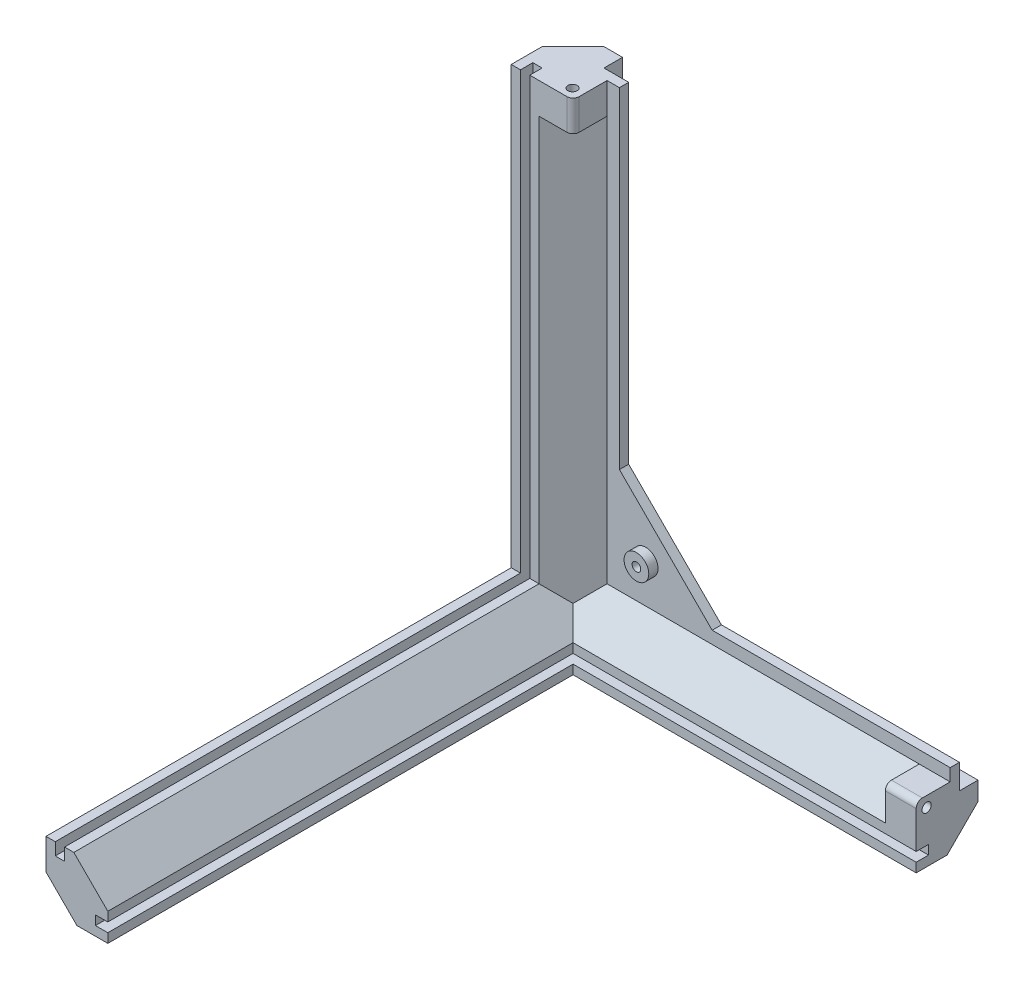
ISO-10303-21;
HEADER;
FILE_DESCRIPTION(('STEP AP214'),'2;1');
FILE_NAME('part.step','',(''),(''),'','','');
FILE_SCHEMA(('AUTOMOTIVE_DESIGN { 1 0 10303 214 1 1 1 1 }'));
ENDSEC;
DATA;
#1=APPLICATION_CONTEXT('core data for automotive mechanical design processes');
#2=APPLICATION_PROTOCOL_DEFINITION('international standard','automotive_design',2000,#1);
#3=PRODUCT_CONTEXT('',#1,'mechanical');
#4=PRODUCT('Part','Part','',(#3));
#5=PRODUCT_RELATED_PRODUCT_CATEGORY('part','',(#4));
#6=PRODUCT_DEFINITION_FORMATION('','',#4);
#7=PRODUCT_DEFINITION_CONTEXT('part definition',#1,'design');
#8=PRODUCT_DEFINITION('design','',#6,#7);
#9=PRODUCT_DEFINITION_SHAPE('','',#8);
#10=(LENGTH_UNIT() NAMED_UNIT(*) SI_UNIT(.MILLI.,.METRE.));
#11=(NAMED_UNIT(*) PLANE_ANGLE_UNIT() SI_UNIT($,.RADIAN.));
#12=(NAMED_UNIT(*) SI_UNIT($,.STERADIAN.) SOLID_ANGLE_UNIT());
#13=UNCERTAINTY_MEASURE_WITH_UNIT(LENGTH_MEASURE(1.E-05),#10,'distance_accuracy_value','');
#14=(GEOMETRIC_REPRESENTATION_CONTEXT(3) GLOBAL_UNCERTAINTY_ASSIGNED_CONTEXT((#13)) GLOBAL_UNIT_ASSIGNED_CONTEXT((#10,
#11,#12)) REPRESENTATION_CONTEXT('',''));
#15=CARTESIAN_POINT('',(0.,0.,0.));
#16=DIRECTION('',(0.,0.,1.));
#17=DIRECTION('',(1.,0.,0.));
#18=AXIS2_PLACEMENT_3D('',#15,#16,#17);
#19=CARTESIAN_POINT('',(-40.0578695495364,4.,-4.45226686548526));
#20=DIRECTION('',(0.,0.,-1.));
#21=DIRECTION('',(-1.,0.,0.));
#22=AXIS2_PLACEMENT_3D('',#19,#20,#21);
#23=PLANE('',#22);
#24=DIRECTION('',(-1.,0.,0.));
#25=VECTOR('',#24,1.);
#26=CARTESIAN_POINT('',(70.9421304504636,0.,-4.45226686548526));
#27=LINE('',#26,#25);
#28=CARTESIAN_POINT('',(70.9421304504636,0.,-4.45226686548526));
#29=VERTEX_POINT('',#28);
#30=CARTESIAN_POINT('',(60.9421304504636,0.,-4.45226686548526));
#31=VERTEX_POINT('',#30);
#32=EDGE_CURVE('E444',#29,#31,#27,.T.);
#33=ORIENTED_EDGE('',*,*,#32,.F.);
#34=DIRECTION('',(0.,-1.,0.));
#35=VECTOR('',#34,1.);
#36=CARTESIAN_POINT('',(70.9421304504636,4.,-4.45226686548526));
#37=LINE('',#36,#35);
#38=CARTESIAN_POINT('',(70.9421304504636,4.,-4.45226686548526));
#39=VERTEX_POINT('',#38);
#40=EDGE_CURVE('E684',#39,#29,#37,.T.);
#41=ORIENTED_EDGE('',*,*,#40,.F.);
#42=DIRECTION('',(1.,0.,0.));
#43=VECTOR('',#42,1.);
#44=CARTESIAN_POINT('',(-40.0578695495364,4.,-4.45226686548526));
#45=LINE('',#44,#43);
#46=CARTESIAN_POINT('',(-6.05786954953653,4.,-4.45226686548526));
#47=VERTEX_POINT('',#46);
#48=EDGE_CURVE('E691',#47,#39,#45,.T.);
#49=ORIENTED_EDGE('',*,*,#48,.F.);
#50=DIRECTION('',(-0.707106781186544,0.707106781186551,0.));
#51=VECTOR('',#50,1.);
#52=CARTESIAN_POINT('',(-23.0578695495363,21.,-4.45226686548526));
#53=LINE('',#52,#51);
#54=CARTESIAN_POINT('',(-36.0578695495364,34.0000000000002,-4.45226686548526));
#55=VERTEX_POINT('',#54);
#56=EDGE_CURVE('E362',#47,#55,#53,.T.);
#57=ORIENTED_EDGE('',*,*,#56,.T.);
#58=DIRECTION('',(0.,-1.,0.));
#59=VECTOR('',#58,1.);
#60=CARTESIAN_POINT('',(-36.0578695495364,4.,-4.45226686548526));
#61=LINE('',#60,#59);
#62=CARTESIAN_POINT('',(-36.0578695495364,141.,-4.45226686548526));
#63=VERTEX_POINT('',#62);
#64=EDGE_CURVE('E701',#63,#55,#61,.T.);
#65=ORIENTED_EDGE('',*,*,#64,.F.);
#66=DIRECTION('',(-1.,0.,0.));
#67=VECTOR('',#66,1.);
#68=CARTESIAN_POINT('',(-36.0578695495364,141.,-4.45226686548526));
#69=LINE('',#68,#67);
#70=CARTESIAN_POINT('',(-40.0578695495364,141.,-4.45226686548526));
#71=VERTEX_POINT('',#70);
#72=EDGE_CURVE('E698',#63,#71,#69,.T.);
#73=ORIENTED_EDGE('',*,*,#72,.T.);
#74=DIRECTION('',(0.,-1.,0.));
#75=VECTOR('',#74,1.);
#76=CARTESIAN_POINT('',(-40.0578695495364,141.,-4.45226686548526));
#77=LINE('',#76,#75);
#78=CARTESIAN_POINT('',(-40.0578695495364,131.,-4.45226686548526));
#79=VERTEX_POINT('',#78);
#80=EDGE_CURVE('E316',#71,#79,#77,.T.);
#81=ORIENTED_EDGE('',*,*,#80,.T.);
#82=CARTESIAN_POINT('',(-40.0578695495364,0.,-4.45226686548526));
#83=VERTEX_POINT('',#82);
#84=EDGE_CURVE('E304',#79,#83,#77,.T.);
#85=ORIENTED_EDGE('',*,*,#84,.T.);
#86=EDGE_CURVE('E430',#31,#83,#27,.T.);
#87=ORIENTED_EDGE('',*,*,#86,.F.);
#88=EDGE_LOOP('',(#33,#41,#49,#57,#65,#73,#81,#85,#87));
#89=FACE_BOUND('',#88,.T.);
#90=CARTESIAN_POINT('',(-27.5578695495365,12.5000000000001,-4.45226686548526));
#91=DIRECTION('',(0.,0.,-1.));
#92=DIRECTION('',(-1.,0.,0.));
#93=AXIS2_PLACEMENT_3D('',#90,#91,#92);
#94=CIRCLE('',#93,4.);
#95=CARTESIAN_POINT('',(-31.5578695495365,12.5000000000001,-4.45226686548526));
#96=VERTEX_POINT('',#95);
#97=EDGE_CURVE('E11',#96,#96,#94,.F.);
#98=ORIENTED_EDGE('',*,*,#97,.F.);
#99=EDGE_LOOP('',(#98));
#100=FACE_BOUND('',#99,.T.);
#101=ADVANCED_FACE('F39',(#89,#100),#23,.F.);
#102=CARTESIAN_POINT('',(70.9421304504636,-11.,6.54773313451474));
#103=DIRECTION('',(0.,-0.707106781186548,-0.707106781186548));
#104=DIRECTION('',(0.,0.707106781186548,-0.707106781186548));
#105=AXIS2_PLACEMENT_3D('',#102,#103,#104);
#106=PLANE('',#105);
#107=DIRECTION('',(0.,0.707106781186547,-0.707106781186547));
#108=VECTOR('',#107,1.);
#109=CARTESIAN_POINT('',(60.9421304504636,-11.,6.54773313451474));
#110=LINE('',#109,#108);
#111=CARTESIAN_POINT('',(60.9421304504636,-11.,6.54773313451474));
#112=VERTEX_POINT('',#111);
#113=EDGE_CURVE('E441',#112,#31,#110,.T.);
#114=ORIENTED_EDGE('',*,*,#113,.T.);
#115=ORIENTED_EDGE('',*,*,#86,.T.);
#116=DIRECTION('',(-0.577350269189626,-0.577350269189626,0.577350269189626));
#117=VECTOR('',#116,1.);
#118=CARTESIAN_POINT('',(6.94213045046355,47.,-51.4522668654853));
#119=LINE('',#118,#117);
#120=CARTESIAN_POINT('',(-45.5578695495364,-5.50000000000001,1.04773313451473));
#121=VERTEX_POINT('',#120);
#122=EDGE_CURVE('E438',#83,#121,#119,.T.);
#123=ORIENTED_EDGE('',*,*,#122,.T.);
#124=DIRECTION('',(-0.577350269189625,0.577350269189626,-0.577350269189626));
#125=VECTOR('',#124,1.);
#126=CARTESIAN_POINT('',(-3.0578695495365,-48.,43.5477331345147));
#127=LINE('',#126,#125);
#128=CARTESIAN_POINT('',(-40.0578695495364,-11.,6.54773313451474));
#129=VERTEX_POINT('',#128);
#130=EDGE_CURVE('E456',#129,#121,#127,.T.);
#131=ORIENTED_EDGE('',*,*,#130,.F.);
#132=DIRECTION('',(-1.,0.,0.));
#133=VECTOR('',#132,1.);
#134=CARTESIAN_POINT('',(70.9421304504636,-11.,6.54773313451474));
#135=LINE('',#134,#133);
#136=EDGE_CURVE('E536',#112,#129,#135,.T.);
#137=ORIENTED_EDGE('',*,*,#136,.F.);
#138=EDGE_LOOP('',(#114,#115,#123,#131,#137));
#139=FACE_BOUND('',#138,.T.);
#140=ADVANCED_FACE('F436',(#139),#106,.F.);
#141=CARTESIAN_POINT('',(0.,4.,0.));
#142=DIRECTION('',(0.,1.,0.));
#143=DIRECTION('',(0.,0.,1.));
#144=AXIS2_PLACEMENT_3D('',#141,#142,#143);
#145=PLANE('',#144);
#146=DIRECTION('',(-1.,0.,0.));
#147=VECTOR('',#146,1.);
#148=CARTESIAN_POINT('',(70.9421304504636,4.,-7.45226686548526));
#149=LINE('',#148,#147);
#150=CARTESIAN_POINT('',(70.9421304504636,4.,-7.45226686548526));
#151=VERTEX_POINT('',#150);
#152=CARTESIAN_POINT('',(-6.05786954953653,4.,-7.45226686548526));
#153=VERTEX_POINT('',#152);
#154=EDGE_CURVE('E694',#151,#153,#149,.T.);
#155=ORIENTED_EDGE('',*,*,#154,.T.);
#156=DIRECTION('',(0.,0.,1.));
#157=VECTOR('',#156,1.);
#158=CARTESIAN_POINT('',(-6.05786954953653,4.,0.));
#159=LINE('',#158,#157);
#160=EDGE_CURVE('E356',#153,#47,#159,.T.);
#161=ORIENTED_EDGE('',*,*,#160,.T.);
#162=ORIENTED_EDGE('',*,*,#48,.T.);
#163=DIRECTION('',(0.,0.,-1.));
#164=VECTOR('',#163,1.);
#165=CARTESIAN_POINT('',(70.9421304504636,4.,-4.45226686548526));
#166=LINE('',#165,#164);
#167=EDGE_CURVE('E687',#39,#151,#166,.T.);
#168=ORIENTED_EDGE('',*,*,#167,.T.);
#169=EDGE_LOOP('',(#155,#161,#162,#168));
#170=FACE_BOUND('',#169,.T.);
#171=ADVANCED_FACE('F778',(#170),#145,.T.);
#172=CARTESIAN_POINT('',(-40.0578695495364,141.,-4.45226686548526));
#173=DIRECTION('',(-0.707106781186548,0.,-0.707106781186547));
#174=DIRECTION('',(-0.707106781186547,0.,0.707106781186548));
#175=AXIS2_PLACEMENT_3D('',#172,#173,#174);
#176=PLANE('',#175);
#177=ORIENTED_EDGE('',*,*,#84,.F.);
#178=DIRECTION('',(-0.707106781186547,0.,0.707106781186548));
#179=VECTOR('',#178,1.);
#180=CARTESIAN_POINT('',(-51.0578695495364,131.,6.54773313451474));
#181=LINE('',#180,#179);
#182=CARTESIAN_POINT('',(-51.0578695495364,131.,6.54773313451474));
#183=VERTEX_POINT('',#182);
#184=EDGE_CURVE('E288',#79,#183,#181,.T.);
#185=ORIENTED_EDGE('',*,*,#184,.T.);
#186=DIRECTION('',(0.,-1.,0.));
#187=VECTOR('',#186,1.);
#188=CARTESIAN_POINT('',(-51.0578695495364,141.,6.54773313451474));
#189=LINE('',#188,#187);
#190=CARTESIAN_POINT('',(-51.0578695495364,0.,6.54773313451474));
#191=VERTEX_POINT('',#190);
#192=EDGE_CURVE('E301',#183,#191,#189,.T.);
#193=ORIENTED_EDGE('',*,*,#192,.T.);
#194=DIRECTION('',(-0.577350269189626,0.577350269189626,0.577350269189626));
#195=VECTOR('',#194,1.);
#196=CARTESIAN_POINT('',(-90.7245362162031,39.6666666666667,46.2143998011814));
#197=LINE('',#196,#195);
#198=EDGE_CURVE('E447',#121,#191,#197,.T.);
#199=ORIENTED_EDGE('',*,*,#198,.F.);
#200=ORIENTED_EDGE('',*,*,#122,.F.);
#201=EDGE_LOOP('',(#177,#185,#193,#199,#200));
#202=FACE_BOUND('',#201,.T.);
#203=ADVANCED_FACE('F299',(#202),#176,.F.);
#204=CARTESIAN_POINT('',(-40.0578695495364,141.,-7.45226686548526));
#205=DIRECTION('',(-1.,0.,0.));
#206=DIRECTION('',(0.,0.,1.));
#207=AXIS2_PLACEMENT_3D('',#204,#205,#206);
#208=PLANE('',#207);
#209=DIRECTION('',(0.,-1.,0.));
#210=VECTOR('',#209,1.);
#211=CARTESIAN_POINT('',(-40.0578695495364,-17.,6.54773313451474));
#212=LINE('',#211,#210);
#213=CARTESIAN_POINT('',(-40.0578695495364,-17.,6.54773313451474));
#214=VERTEX_POINT('',#213);
#215=CARTESIAN_POINT('',(-40.0578695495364,-20.,6.54773313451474));
#216=VERTEX_POINT('',#215);
#217=EDGE_CURVE('E472',#214,#216,#212,.T.);
#218=ORIENTED_EDGE('',*,*,#217,.F.);
#219=DIRECTION('',(0.,0.,-1.));
#220=VECTOR('',#219,1.);
#221=CARTESIAN_POINT('',(-40.0578695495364,-17.,157.047733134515));
#222=LINE('',#221,#220);
#223=CARTESIAN_POINT('',(-40.0578695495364,-17.,157.047733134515));
#224=VERTEX_POINT('',#223);
#225=EDGE_CURVE('E605',#224,#214,#222,.T.);
#226=ORIENTED_EDGE('',*,*,#225,.F.);
#227=DIRECTION('',(0.,1.,0.));
#228=VECTOR('',#227,1.);
#229=CARTESIAN_POINT('',(-40.0578695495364,-20.,157.047733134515));
#230=LINE('',#229,#228);
#231=CARTESIAN_POINT('',(-40.0578695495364,-20.,157.047733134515));
#232=VERTEX_POINT('',#231);
#233=EDGE_CURVE('E566',#232,#224,#230,.T.);
#234=ORIENTED_EDGE('',*,*,#233,.F.);
#235=DIRECTION('',(0.,0.,-1.));
#236=VECTOR('',#235,1.);
#237=CARTESIAN_POINT('',(-40.0578695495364,-20.,6.54773313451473));
#238=LINE('',#237,#236);
#239=EDGE_CURVE('E637',#232,#216,#238,.T.);
#240=ORIENTED_EDGE('',*,*,#239,.T.);
#241=EDGE_LOOP('',(#218,#226,#234,#240));
#242=FACE_BOUND('',#241,.T.);
#243=ADVANCED_FACE('F853',(#242),#208,.F.);
#244=DIRECTION('',(0.,-1.,0.));
#245=VECTOR('',#244,1.);
#246=CARTESIAN_POINT('',(-40.0578695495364,-11.,6.54773313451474));
#247=LINE('',#246,#245);
#248=CARTESIAN_POINT('',(-40.0578695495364,-14.,6.54773313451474));
#249=VERTEX_POINT('',#248);
#250=EDGE_CURVE('E467',#129,#249,#247,.T.);
#251=ORIENTED_EDGE('',*,*,#250,.F.);
#252=DIRECTION('',(0.,0.,-1.));
#253=VECTOR('',#252,1.);
#254=CARTESIAN_POINT('',(-40.0578695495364,-11.,157.047733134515));
#255=LINE('',#254,#253);
#256=CARTESIAN_POINT('',(-40.0578695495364,-11.,157.047733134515));
#257=VERTEX_POINT('',#256);
#258=EDGE_CURVE('E592',#257,#129,#255,.T.);
#259=ORIENTED_EDGE('',*,*,#258,.F.);
#260=DIRECTION('',(0.,1.,0.));
#261=VECTOR('',#260,1.);
#262=CARTESIAN_POINT('',(-40.0578695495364,-14.,157.047733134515));
#263=LINE('',#262,#261);
#264=CARTESIAN_POINT('',(-40.0578695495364,-14.,157.047733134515));
#265=VERTEX_POINT('',#264);
#266=EDGE_CURVE('E578',#265,#257,#263,.T.);
#267=ORIENTED_EDGE('',*,*,#266,.F.);
#268=DIRECTION('',(0.,0.,-1.));
#269=VECTOR('',#268,1.);
#270=CARTESIAN_POINT('',(-40.0578695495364,-14.,157.047733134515));
#271=LINE('',#270,#269);
#272=EDGE_CURVE('E596',#265,#249,#271,.T.);
#273=ORIENTED_EDGE('',*,*,#272,.T.);
#274=EDGE_LOOP('',(#251,#259,#267,#273));
#275=FACE_BOUND('',#274,.T.);
#276=ADVANCED_FACE('F856',(#275),#208,.F.);
#277=CARTESIAN_POINT('',(-54.0578695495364,141.,6.54773313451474));
#278=DIRECTION('',(0.,0.,-1.));
#279=DIRECTION('',(-1.,0.,0.));
#280=AXIS2_PLACEMENT_3D('',#277,#278,#279);
#281=PLANE('',#280);
#282=DIRECTION('',(1.,0.,0.));
#283=VECTOR('',#282,1.);
#284=CARTESIAN_POINT('',(-40.0578695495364,131.,6.54773313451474));
#285=LINE('',#284,#283);
#286=CARTESIAN_POINT('',(-42.0578695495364,131.,6.54773313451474));
#287=VERTEX_POINT('',#286);
#288=EDGE_CURVE('E285',#183,#287,#285,.T.);
#289=ORIENTED_EDGE('',*,*,#288,.T.);
#290=DIRECTION('',(0.,1.,0.));
#291=VECTOR('',#290,1.);
#292=CARTESIAN_POINT('',(-42.0578695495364,141.,6.54773313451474));
#293=LINE('',#292,#291);
#294=CARTESIAN_POINT('',(-42.0578695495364,141.,6.54773313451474));
#295=VERTEX_POINT('',#294);
#296=EDGE_CURVE('E391',#287,#295,#293,.T.);
#297=ORIENTED_EDGE('',*,*,#296,.T.);
#298=DIRECTION('',(1.,0.,0.));
#299=VECTOR('',#298,1.);
#300=CARTESIAN_POINT('',(-54.0578695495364,141.,6.54773313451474));
#301=LINE('',#300,#299);
#302=CARTESIAN_POINT('',(-54.0578695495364,141.,6.54773313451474));
#303=VERTEX_POINT('',#302);
#304=EDGE_CURVE('E399',#303,#295,#301,.T.);
#305=ORIENTED_EDGE('',*,*,#304,.F.);
#306=DIRECTION('',(0.,-1.,0.));
#307=VECTOR('',#306,1.);
#308=CARTESIAN_POINT('',(-54.0578695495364,141.,6.54773313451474));
#309=LINE('',#308,#307);
#310=CARTESIAN_POINT('',(-54.0578695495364,0.,6.54773313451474));
#311=VERTEX_POINT('',#310);
#312=EDGE_CURVE('E315',#303,#311,#309,.T.);
#313=ORIENTED_EDGE('',*,*,#312,.T.);
#314=DIRECTION('',(-1.,0.,0.));
#315=VECTOR('',#314,1.);
#316=CARTESIAN_POINT('',(-54.0578695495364,0.,6.54773313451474));
#317=LINE('',#316,#315);
#318=EDGE_CURVE('E312',#191,#311,#317,.T.);
#319=ORIENTED_EDGE('',*,*,#318,.F.);
#320=ORIENTED_EDGE('',*,*,#192,.F.);
#321=EDGE_LOOP('',(#289,#297,#305,#313,#319,#320));
#322=FACE_BOUND('',#321,.T.);
#323=ADVANCED_FACE('F310',(#322),#281,.F.);
#324=DIRECTION('',(-1.,0.,0.));
#325=VECTOR('',#324,1.);
#326=CARTESIAN_POINT('',(-57.0578695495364,0.,6.54773313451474));
#327=LINE('',#326,#325);
#328=CARTESIAN_POINT('',(-57.0578695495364,0.,6.54773313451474));
#329=VERTEX_POINT('',#328);
#330=CARTESIAN_POINT('',(-60.0578695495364,0.,6.54773313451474));
#331=VERTEX_POINT('',#330);
#332=EDGE_CURVE('E544',#329,#331,#327,.T.);
#333=ORIENTED_EDGE('',*,*,#332,.F.);
#334=DIRECTION('',(0.,-1.,0.));
#335=VECTOR('',#334,1.);
#336=CARTESIAN_POINT('',(-57.0578695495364,141.,6.54773313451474));
#337=LINE('',#336,#335);
#338=CARTESIAN_POINT('',(-57.0578695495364,141.,6.54773313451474));
#339=VERTEX_POINT('',#338);
#340=EDGE_CURVE('E330',#339,#329,#337,.T.);
#341=ORIENTED_EDGE('',*,*,#340,.F.);
#342=DIRECTION('',(1.,0.,0.));
#343=VECTOR('',#342,1.);
#344=CARTESIAN_POINT('',(-60.0578695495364,141.,6.54773313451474));
#345=LINE('',#344,#343);
#346=CARTESIAN_POINT('',(-60.0578695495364,141.,6.54773313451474));
#347=VERTEX_POINT('',#346);
#348=EDGE_CURVE('E649',#347,#339,#345,.T.);
#349=ORIENTED_EDGE('',*,*,#348,.F.);
#350=DIRECTION('',(0.,-1.,0.));
#351=VECTOR('',#350,1.);
#352=CARTESIAN_POINT('',(-60.0578695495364,141.,6.54773313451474));
#353=LINE('',#352,#351);
#354=EDGE_CURVE('E334',#347,#331,#353,.T.);
#355=ORIENTED_EDGE('',*,*,#354,.T.);
#356=EDGE_LOOP('',(#333,#341,#349,#355));
#357=FACE_BOUND('',#356,.T.);
#358=ADVANCED_FACE('F862',(#357),#281,.F.);
#359=CARTESIAN_POINT('',(-50.0578695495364,141.,-13.4522668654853));
#360=DIRECTION('',(0.,0.,1.));
#361=DIRECTION('',(1.,0.,0.));
#362=AXIS2_PLACEMENT_3D('',#359,#360,#361);
#363=PLANE('',#362);
#364=DIRECTION('',(-1.,0.,0.));
#365=VECTOR('',#364,1.);
#366=CARTESIAN_POINT('',(-50.0578695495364,141.,-13.4522668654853));
#367=LINE('',#366,#365);
#368=CARTESIAN_POINT('',(-44.0578695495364,141.,-13.4522668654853));
#369=VERTEX_POINT('',#368);
#370=CARTESIAN_POINT('',(-50.0578695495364,141.,-13.4522668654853));
#371=VERTEX_POINT('',#370);
#372=EDGE_CURVE('E640',#369,#371,#367,.T.);
#373=ORIENTED_EDGE('',*,*,#372,.F.);
#374=DIRECTION('',(0.,-1.,0.));
#375=VECTOR('',#374,1.);
#376=CARTESIAN_POINT('',(-44.0578695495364,141.,-13.4522668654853));
#377=LINE('',#376,#375);
#378=CARTESIAN_POINT('',(-44.0578695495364,16.0000000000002,-13.4522668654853));
#379=VERTEX_POINT('',#378);
#380=EDGE_CURVE('E678',#369,#379,#377,.T.);
#381=ORIENTED_EDGE('',*,*,#380,.T.);
#382=DIRECTION('',(-0.707106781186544,0.707106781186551,0.));
#383=VECTOR('',#382,1.);
#384=CARTESIAN_POINT('',(-109.557869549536,81.5000000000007,-13.4522668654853));
#385=LINE('',#384,#383);
#386=CARTESIAN_POINT('',(-24.0578695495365,-4.,-13.4522668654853));
#387=VERTEX_POINT('',#386);
#388=EDGE_CURVE('E375',#379,#387,#385,.F.);
#389=ORIENTED_EDGE('',*,*,#388,.T.);
#390=DIRECTION('',(1.,0.,0.));
#391=VECTOR('',#390,1.);
#392=CARTESIAN_POINT('',(-44.0578695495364,-4.,-13.4522668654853));
#393=LINE('',#392,#391);
#394=CARTESIAN_POINT('',(70.9421304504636,-4.,-13.4522668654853));
#395=VERTEX_POINT('',#394);
#396=EDGE_CURVE('E676',#387,#395,#393,.T.);
#397=ORIENTED_EDGE('',*,*,#396,.T.);
#398=DIRECTION('',(0.,1.,0.));
#399=VECTOR('',#398,1.);
#400=CARTESIAN_POINT('',(70.9421304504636,0.,-13.4522668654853));
#401=LINE('',#400,#399);
#402=CARTESIAN_POINT('',(70.9421304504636,-10.,-13.4522668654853));
#403=VERTEX_POINT('',#402);
#404=EDGE_CURVE('E490',#403,#395,#401,.T.);
#405=ORIENTED_EDGE('',*,*,#404,.F.);
#406=DIRECTION('',(-1.,0.,0.));
#407=VECTOR('',#406,1.);
#408=CARTESIAN_POINT('',(70.9421304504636,-10.,-13.4522668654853));
#409=LINE('',#408,#407);
#410=CARTESIAN_POINT('',(-50.0578695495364,-10.,-13.4522668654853));
#411=VERTEX_POINT('',#410);
#412=EDGE_CURVE('E510',#403,#411,#409,.T.);
#413=ORIENTED_EDGE('',*,*,#412,.T.);
#414=DIRECTION('',(0.,-1.,0.));
#415=VECTOR('',#414,1.);
#416=CARTESIAN_POINT('',(-50.0578695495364,141.,-13.4522668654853));
#417=LINE('',#416,#415);
#418=EDGE_CURVE('E340',#371,#411,#417,.T.);
#419=ORIENTED_EDGE('',*,*,#418,.F.);
#420=EDGE_LOOP('',(#373,#381,#389,#397,#405,#413,#419));
#421=FACE_BOUND('',#420,.T.);
#422=ADVANCED_FACE('F878',(#421),#363,.F.);
#423=CARTESIAN_POINT('',(-60.0578695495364,141.,-3.45226686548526));
#424=DIRECTION('',(0.707106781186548,0.,0.707106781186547));
#425=DIRECTION('',(0.707106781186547,0.,-0.707106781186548));
#426=AXIS2_PLACEMENT_3D('',#423,#424,#425);
#427=PLANE('',#426);
#428=ORIENTED_EDGE('',*,*,#418,.T.);
#429=DIRECTION('',(-0.577350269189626,-0.577350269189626,0.577350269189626));
#430=VECTOR('',#429,1.);
#431=CARTESIAN_POINT('',(-6.39120288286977,33.6666666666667,-57.1189335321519));
#432=LINE('',#431,#430);
#433=CARTESIAN_POINT('',(-55.0578695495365,-15.,-8.45226686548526));
#434=VERTEX_POINT('',#433);
#435=EDGE_CURVE('E463',#411,#434,#432,.T.);
#436=ORIENTED_EDGE('',*,*,#435,.T.);
#437=DIRECTION('',(0.577350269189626,-0.577350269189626,-0.577350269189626));
#438=VECTOR('',#437,1.);
#439=CARTESIAN_POINT('',(-106.89120288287,36.8333333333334,43.3810664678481));
#440=LINE('',#439,#438);
#441=CARTESIAN_POINT('',(-60.0578695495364,-9.99999999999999,-3.45226686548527));
#442=VERTEX_POINT('',#441);
#443=EDGE_CURVE('E344',#442,#434,#440,.T.);
#444=ORIENTED_EDGE('',*,*,#443,.F.);
#445=DIRECTION('',(0.,-1.,0.));
#446=VECTOR('',#445,1.);
#447=CARTESIAN_POINT('',(-60.0578695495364,141.,-3.45226686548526));
#448=LINE('',#447,#446);
#449=CARTESIAN_POINT('',(-60.0578695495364,141.,-3.45226686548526));
#450=VERTEX_POINT('',#449);
#451=EDGE_CURVE('E337',#450,#442,#448,.T.);
#452=ORIENTED_EDGE('',*,*,#451,.F.);
#453=DIRECTION('',(-0.707106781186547,0.,0.707106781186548));
#454=VECTOR('',#453,1.);
#455=CARTESIAN_POINT('',(-60.0578695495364,141.,-3.45226686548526));
#456=LINE('',#455,#454);
#457=EDGE_CURVE('E643',#371,#450,#456,.T.);
#458=ORIENTED_EDGE('',*,*,#457,.F.);
#459=EDGE_LOOP('',(#428,#436,#444,#452,#458));
#460=FACE_BOUND('',#459,.T.);
#461=ADVANCED_FACE('F874',(#460),#427,.F.);
#462=CARTESIAN_POINT('',(-60.0578695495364,141.,-3.45226686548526));
#463=DIRECTION('',(1.,0.,0.));
#464=DIRECTION('',(0.,0.,-1.));
#465=AXIS2_PLACEMENT_3D('',#462,#463,#464);
#466=PLANE('',#465);
#467=ORIENTED_EDGE('',*,*,#451,.T.);
#468=DIRECTION('',(0.,0.,-1.));
#469=VECTOR('',#468,1.);
#470=CARTESIAN_POINT('',(-60.0578695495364,-10.,157.047733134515));
#471=LINE('',#470,#469);
#472=CARTESIAN_POINT('',(-60.0578695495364,-10.,157.047733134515));
#473=VERTEX_POINT('',#472);
#474=EDGE_CURVE('E613',#473,#442,#471,.T.);
#475=ORIENTED_EDGE('',*,*,#474,.F.);
#476=DIRECTION('',(0.,-1.,0.));
#477=VECTOR('',#476,1.);
#478=CARTESIAN_POINT('',(-60.0578695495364,0.,157.047733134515));
#479=LINE('',#478,#477);
#480=CARTESIAN_POINT('',(-60.0578695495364,0.,157.047733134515));
#481=VERTEX_POINT('',#480);
#482=EDGE_CURVE('E556',#481,#473,#479,.T.);
#483=ORIENTED_EDGE('',*,*,#482,.F.);
#484=DIRECTION('',(0.,0.,-1.));
#485=VECTOR('',#484,1.);
#486=CARTESIAN_POINT('',(-60.0578695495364,0.,157.047733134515));
#487=LINE('',#486,#485);
#488=EDGE_CURVE('E617',#481,#331,#487,.T.);
#489=ORIENTED_EDGE('',*,*,#488,.T.);
#490=ORIENTED_EDGE('',*,*,#354,.F.);
#491=DIRECTION('',(0.,0.,1.));
#492=VECTOR('',#491,1.);
#493=CARTESIAN_POINT('',(-60.0578695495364,141.,-3.45226686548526));
#494=LINE('',#493,#492);
#495=EDGE_CURVE('E646',#450,#347,#494,.T.);
#496=ORIENTED_EDGE('',*,*,#495,.F.);
#497=EDGE_LOOP('',(#467,#475,#483,#489,#490,#496));
#498=FACE_BOUND('',#497,.T.);
#499=ADVANCED_FACE('F870',(#498),#466,.F.);
#500=CARTESIAN_POINT('',(-57.0578695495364,141.,6.54773313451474));
#501=DIRECTION('',(-1.,0.,0.));
#502=DIRECTION('',(0.,0.,1.));
#503=AXIS2_PLACEMENT_3D('',#500,#501,#502);
#504=PLANE('',#503);
#505=ORIENTED_EDGE('',*,*,#340,.T.);
#506=DIRECTION('',(0.,0.,-1.));
#507=VECTOR('',#506,1.);
#508=CARTESIAN_POINT('',(-57.0578695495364,0.,157.047733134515));
#509=LINE('',#508,#507);
#510=CARTESIAN_POINT('',(-57.0578695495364,0.,157.047733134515));
#511=VERTEX_POINT('',#510);
#512=EDGE_CURVE('E621',#511,#329,#509,.T.);
#513=ORIENTED_EDGE('',*,*,#512,.F.);
#514=DIRECTION('',(0.,1.,0.));
#515=VECTOR('',#514,1.);
#516=CARTESIAN_POINT('',(-57.0578695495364,0.,157.047733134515));
#517=LINE('',#516,#515);
#518=CARTESIAN_POINT('',(-57.0578695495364,-4.,157.047733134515));
#519=VERTEX_POINT('',#518);
#520=EDGE_CURVE('E550',#519,#511,#517,.T.);
#521=ORIENTED_EDGE('',*,*,#520,.F.);
#522=DIRECTION('',(0.,0.,-1.));
#523=VECTOR('',#522,1.);
#524=CARTESIAN_POINT('',(-57.0578695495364,-4.,157.047733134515));
#525=LINE('',#524,#523);
#526=CARTESIAN_POINT('',(-57.0578695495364,-3.99999999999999,2.54773313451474));
#527=VERTEX_POINT('',#526);
#528=EDGE_CURVE('E625',#519,#527,#525,.T.);
#529=ORIENTED_EDGE('',*,*,#528,.T.);
#530=DIRECTION('',(0.,-1.,0.));
#531=VECTOR('',#530,1.);
#532=CARTESIAN_POINT('',(-57.0578695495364,141.,2.54773313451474));
#533=LINE('',#532,#531);
#534=CARTESIAN_POINT('',(-57.0578695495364,141.,2.54773313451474));
#535=VERTEX_POINT('',#534);
#536=EDGE_CURVE('E327',#535,#527,#533,.T.);
#537=ORIENTED_EDGE('',*,*,#536,.F.);
#538=DIRECTION('',(0.,0.,-1.));
#539=VECTOR('',#538,1.);
#540=CARTESIAN_POINT('',(-57.0578695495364,141.,6.54773313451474));
#541=LINE('',#540,#539);
#542=EDGE_CURVE('E652',#339,#535,#541,.T.);
#543=ORIENTED_EDGE('',*,*,#542,.F.);
#544=EDGE_LOOP('',(#505,#513,#521,#529,#537,#543));
#545=FACE_BOUND('',#544,.T.);
#546=ADVANCED_FACE('F867',(#545),#504,.F.);
#547=CARTESIAN_POINT('',(-57.0578695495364,141.,2.54773313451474));
#548=DIRECTION('',(0.,0.,-1.));
#549=DIRECTION('',(-1.,0.,0.));
#550=AXIS2_PLACEMENT_3D('',#547,#548,#549);
#551=PLANE('',#550);
#552=ORIENTED_EDGE('',*,*,#536,.T.);
#553=DIRECTION('',(-1.,0.,0.));
#554=VECTOR('',#553,1.);
#555=CARTESIAN_POINT('',(-57.0578695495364,-3.99999999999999,2.54773313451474));
#556=LINE('',#555,#554);
#557=CARTESIAN_POINT('',(-54.0578695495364,-3.99999999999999,2.54773313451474));
#558=VERTEX_POINT('',#557);
#559=EDGE_CURVE('E449',#558,#527,#556,.T.);
#560=ORIENTED_EDGE('',*,*,#559,.F.);
#561=DIRECTION('',(0.,-1.,0.));
#562=VECTOR('',#561,1.);
#563=CARTESIAN_POINT('',(-54.0578695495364,141.,2.54773313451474));
#564=LINE('',#563,#562);
#565=CARTESIAN_POINT('',(-54.0578695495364,141.,2.54773313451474));
#566=VERTEX_POINT('',#565);
#567=EDGE_CURVE('E320',#566,#558,#564,.T.);
#568=ORIENTED_EDGE('',*,*,#567,.F.);
#569=DIRECTION('',(1.,0.,0.));
#570=VECTOR('',#569,1.);
#571=CARTESIAN_POINT('',(-57.0578695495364,141.,2.54773313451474));
#572=LINE('',#571,#570);
#573=EDGE_CURVE('E413',#535,#566,#572,.T.);
#574=ORIENTED_EDGE('',*,*,#573,.F.);
#575=EDGE_LOOP('',(#552,#560,#568,#574));
#576=FACE_BOUND('',#575,.T.);
#577=ADVANCED_FACE('F661',(#576),#551,.F.);
#578=CARTESIAN_POINT('',(-54.0578695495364,141.,2.54773313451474));
#579=DIRECTION('',(1.,0.,0.));
#580=DIRECTION('',(0.,0.,-1.));
#581=AXIS2_PLACEMENT_3D('',#578,#579,#580);
#582=PLANE('',#581);
#583=ORIENTED_EDGE('',*,*,#567,.T.);
#584=DIRECTION('',(0.,0.,-1.));
#585=VECTOR('',#584,1.);
#586=CARTESIAN_POINT('',(-54.0578695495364,-4.,157.047733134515));
#587=LINE('',#586,#585);
#588=CARTESIAN_POINT('',(-54.0578695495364,-4.,157.047733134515));
#589=VERTEX_POINT('',#588);
#590=EDGE_CURVE('E629',#589,#558,#587,.T.);
#591=ORIENTED_EDGE('',*,*,#590,.F.);
#592=DIRECTION('',(0.,-1.,0.));
#593=VECTOR('',#592,1.);
#594=CARTESIAN_POINT('',(-54.0578695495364,-4.,157.047733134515));
#595=LINE('',#594,#593);
#596=CARTESIAN_POINT('',(-54.0578695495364,0.,157.047733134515));
#597=VERTEX_POINT('',#596);
#598=EDGE_CURVE('E543',#597,#589,#595,.T.);
#599=ORIENTED_EDGE('',*,*,#598,.F.);
#600=DIRECTION('',(0.,0.,-1.));
#601=VECTOR('',#600,1.);
#602=CARTESIAN_POINT('',(-54.0578695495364,0.,157.047733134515));
#603=LINE('',#602,#601);
#604=EDGE_CURVE('E633',#597,#311,#603,.T.);
#605=ORIENTED_EDGE('',*,*,#604,.T.);
#606=ORIENTED_EDGE('',*,*,#312,.F.);
#607=DIRECTION('',(0.,0.,1.));
#608=VECTOR('',#607,1.);
#609=CARTESIAN_POINT('',(-54.0578695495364,141.,2.54773313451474));
#610=LINE('',#609,#608);
#611=EDGE_CURVE('E404',#566,#303,#610,.T.);
#612=ORIENTED_EDGE('',*,*,#611,.F.);
#613=EDGE_LOOP('',(#583,#591,#599,#605,#606,#612));
#614=FACE_BOUND('',#613,.T.);
#615=ADVANCED_FACE('F664',(#614),#582,.F.);
#616=CARTESIAN_POINT('',(-44.0578695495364,141.,-7.45226686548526));
#617=DIRECTION('',(0.,0.,1.));
#618=DIRECTION('',(1.,0.,0.));
#619=AXIS2_PLACEMENT_3D('',#616,#617,#618);
#620=PLANE('',#619);
#621=CARTESIAN_POINT('',(-27.5578695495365,12.5000000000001,-7.45226686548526));
#622=DIRECTION('',(0.,0.,-1.));
#623=DIRECTION('',(-1.,0.,0.));
#624=AXIS2_PLACEMENT_3D('',#621,#622,#623);
#625=CIRCLE('',#624,1.4);
#626=CARTESIAN_POINT('',(-28.9578695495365,12.5000000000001,-7.45226686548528));
#627=VERTEX_POINT('',#626);
#628=EDGE_CURVE('E711',#627,#627,#625,.T.);
#629=ORIENTED_EDGE('',*,*,#628,.F.);
#630=EDGE_LOOP('',(#629));
#631=FACE_BOUND('',#630,.T.);
#632=DIRECTION('',(-1.,0.,0.));
#633=VECTOR('',#632,1.);
#634=CARTESIAN_POINT('',(70.9421304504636,-4.,-7.45226686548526));
#635=LINE('',#634,#633);
#636=CARTESIAN_POINT('',(70.9421304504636,-4.,-7.45226686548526));
#637=VERTEX_POINT('',#636);
#638=CARTESIAN_POINT('',(-24.0578695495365,-4.,-7.45226686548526));
#639=VERTEX_POINT('',#638);
#640=EDGE_CURVE('E506',#637,#639,#635,.T.);
#641=ORIENTED_EDGE('',*,*,#640,.T.);
#642=DIRECTION('',(0.707106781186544,-0.707106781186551,0.));
#643=VECTOR('',#642,1.);
#644=CARTESIAN_POINT('',(-44.0578695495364,16.0000000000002,-7.45226686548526));
#645=LINE('',#644,#643);
#646=CARTESIAN_POINT('',(-44.0578695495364,16.0000000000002,-7.45226686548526));
#647=VERTEX_POINT('',#646);
#648=EDGE_CURVE('E372',#639,#647,#645,.F.);
#649=ORIENTED_EDGE('',*,*,#648,.T.);
#650=DIRECTION('',(0.,-1.,0.));
#651=VECTOR('',#650,1.);
#652=CARTESIAN_POINT('',(-44.0578695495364,141.,-7.45226686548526));
#653=LINE('',#652,#651);
#654=CARTESIAN_POINT('',(-44.0578695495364,141.,-7.45226686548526));
#655=VERTEX_POINT('',#654);
#656=EDGE_CURVE('E418',#655,#647,#653,.T.);
#657=ORIENTED_EDGE('',*,*,#656,.F.);
#658=DIRECTION('',(-1.,0.,0.));
#659=VECTOR('',#658,1.);
#660=CARTESIAN_POINT('',(-44.0578695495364,141.,-7.45226686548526));
#661=LINE('',#660,#659);
#662=CARTESIAN_POINT('',(-36.0578695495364,141.,-7.45226686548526));
#663=VERTEX_POINT('',#662);
#664=EDGE_CURVE('E407',#663,#655,#661,.T.);
#665=ORIENTED_EDGE('',*,*,#664,.F.);
#666=DIRECTION('',(0.,1.,0.));
#667=VECTOR('',#666,1.);
#668=CARTESIAN_POINT('',(-36.0578695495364,141.,-7.45226686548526));
#669=LINE('',#668,#667);
#670=CARTESIAN_POINT('',(-36.0578695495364,34.0000000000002,-7.45226686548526));
#671=VERTEX_POINT('',#670);
#672=EDGE_CURVE('E708',#671,#663,#669,.T.);
#673=ORIENTED_EDGE('',*,*,#672,.F.);
#674=DIRECTION('',(0.707106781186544,-0.707106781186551,0.));
#675=VECTOR('',#674,1.);
#676=CARTESIAN_POINT('',(-93.5578695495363,91.5000000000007,-7.45226686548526));
#677=LINE('',#676,#675);
#678=EDGE_CURVE('E359',#671,#153,#677,.T.);
#679=ORIENTED_EDGE('',*,*,#678,.T.);
#680=ORIENTED_EDGE('',*,*,#154,.F.);
#681=DIRECTION('',(0.,1.,0.));
#682=VECTOR('',#681,1.);
#683=CARTESIAN_POINT('',(70.9421304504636,0.,-7.45226686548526));
#684=LINE('',#683,#682);
#685=EDGE_CURVE('E445',#637,#151,#684,.T.);
#686=ORIENTED_EDGE('',*,*,#685,.F.);
#687=EDGE_LOOP('',(#641,#649,#657,#665,#673,#679,#680,#686));
#688=FACE_BOUND('',#687,.T.);
#689=ADVANCED_FACE('F849',(#631,#688),#620,.F.);
#690=CARTESIAN_POINT('',(-44.0578695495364,141.,-10.4522668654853));
#691=DIRECTION('',(-1.,0.,0.));
#692=DIRECTION('',(0.,0.,1.));
#693=AXIS2_PLACEMENT_3D('',#690,#691,#692);
#694=PLANE('',#693);
#695=ORIENTED_EDGE('',*,*,#656,.T.);
#696=DIRECTION('',(0.,0.,-1.));
#697=VECTOR('',#696,1.);
#698=CARTESIAN_POINT('',(-44.0578695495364,16.0000000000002,-13.4522668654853));
#699=LINE('',#698,#697);
#700=EDGE_CURVE('E365',#647,#379,#699,.T.);
#701=ORIENTED_EDGE('',*,*,#700,.T.);
#702=ORIENTED_EDGE('',*,*,#380,.F.);
#703=DIRECTION('',(0.,0.,-1.));
#704=VECTOR('',#703,1.);
#705=CARTESIAN_POINT('',(-44.0578695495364,141.,-10.4522668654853));
#706=LINE('',#705,#704);
#707=EDGE_CURVE('E411',#655,#369,#706,.T.);
#708=ORIENTED_EDGE('',*,*,#707,.F.);
#709=EDGE_LOOP('',(#695,#701,#702,#708));
#710=FACE_BOUND('',#709,.T.);
#711=ADVANCED_FACE('F846',(#710),#694,.F.);
#712=CARTESIAN_POINT('',(0.,141.,0.));
#713=DIRECTION('',(0.,1.,0.));
#714=DIRECTION('',(0.,0.,1.));
#715=AXIS2_PLACEMENT_3D('',#712,#713,#714);
#716=PLANE('',#715);
#717=ORIENTED_EDGE('',*,*,#304,.T.);
#718=CARTESIAN_POINT('',(-42.0578695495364,141.,4.54773313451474));
#719=DIRECTION('',(0.,1.,0.));
#720=DIRECTION('',(0.,0.,1.));
#721=AXIS2_PLACEMENT_3D('',#718,#719,#720);
#722=CIRCLE('',#721,2.);
#723=CARTESIAN_POINT('',(-40.0578695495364,141.,4.54773313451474));
#724=VERTEX_POINT('',#723);
#725=EDGE_CURVE('E63',#295,#724,#722,.T.);
#726=ORIENTED_EDGE('',*,*,#725,.T.);
#727=DIRECTION('',(0.,0.,-1.));
#728=VECTOR('',#727,1.);
#729=CARTESIAN_POINT('',(-40.0578695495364,141.,-4.45226686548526));
#730=LINE('',#729,#728);
#731=EDGE_CURVE('E307',#724,#71,#730,.T.);
#732=ORIENTED_EDGE('',*,*,#731,.T.);
#733=ORIENTED_EDGE('',*,*,#72,.F.);
#734=DIRECTION('',(0.,0.,1.));
#735=VECTOR('',#734,1.);
#736=CARTESIAN_POINT('',(-36.0578695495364,141.,-4.45226686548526));
#737=LINE('',#736,#735);
#738=EDGE_CURVE('E705',#663,#63,#737,.T.);
#739=ORIENTED_EDGE('',*,*,#738,.F.);
#740=ORIENTED_EDGE('',*,*,#664,.T.);
#741=ORIENTED_EDGE('',*,*,#707,.T.);
#742=ORIENTED_EDGE('',*,*,#372,.T.);
#743=ORIENTED_EDGE('',*,*,#457,.T.);
#744=ORIENTED_EDGE('',*,*,#495,.T.);
#745=ORIENTED_EDGE('',*,*,#348,.T.);
#746=ORIENTED_EDGE('',*,*,#542,.T.);
#747=ORIENTED_EDGE('',*,*,#573,.T.);
#748=ORIENTED_EDGE('',*,*,#611,.T.);
#749=EDGE_LOOP('',(#717,#726,#732,#733,#739,#740,#741,#742,#743,#744,#745,#746,#747,#748));
#750=FACE_BOUND('',#749,.T.);
#751=CARTESIAN_POINT('',(-43.5160097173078,141.,3.24851398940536));
#752=DIRECTION('',(0.,1.,0.));
#753=DIRECTION('',(0.,0.,1.));
#754=AXIS2_PLACEMENT_3D('',#751,#752,#753);
#755=CIRCLE('',#754,1.5);
#756=CARTESIAN_POINT('',(-43.5160097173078,141.,4.74851398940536));
#757=VERTEX_POINT('',#756);
#758=EDGE_CURVE('E741',#757,#757,#755,.T.);
#759=ORIENTED_EDGE('',*,*,#758,.F.);
#760=EDGE_LOOP('',(#759));
#761=FACE_BOUND('',#760,.T.);
#762=ADVANCED_FACE('F401',(#750,#761),#716,.T.);
#763=CARTESIAN_POINT('',(-40.0578695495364,-20.,6.54773313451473));
#764=DIRECTION('',(0.,-1.,0.));
#765=DIRECTION('',(0.,0.,-1.));
#766=AXIS2_PLACEMENT_3D('',#763,#764,#765);
#767=PLANE('',#766);
#768=DIRECTION('',(0.,0.,-1.));
#769=VECTOR('',#768,1.);
#770=CARTESIAN_POINT('',(-50.0578695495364,-20.,157.047733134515));
#771=LINE('',#770,#769);
#772=CARTESIAN_POINT('',(-50.0578695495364,-20.,157.047733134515));
#773=VERTEX_POINT('',#772);
#774=CARTESIAN_POINT('',(-50.0578695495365,-20.,-3.45226686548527));
#775=VERTEX_POINT('',#774);
#776=EDGE_CURVE('E609',#773,#775,#771,.T.);
#777=ORIENTED_EDGE('',*,*,#776,.T.);
#778=DIRECTION('',(-1.,0.,0.));
#779=VECTOR('',#778,1.);
#780=CARTESIAN_POINT('',(70.9421304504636,-20.,-3.45226686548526));
#781=LINE('',#780,#779);
#782=CARTESIAN_POINT('',(70.9421304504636,-20.,-3.45226686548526));
#783=VERTEX_POINT('',#782);
#784=EDGE_CURVE('E513',#783,#775,#781,.T.);
#785=ORIENTED_EDGE('',*,*,#784,.F.);
#786=DIRECTION('',(0.,0.,-1.));
#787=VECTOR('',#786,1.);
#788=CARTESIAN_POINT('',(70.9421304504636,-20.,6.54773313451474));
#789=LINE('',#788,#787);
#790=CARTESIAN_POINT('',(70.9421304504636,-20.,6.54773313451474));
#791=VERTEX_POINT('',#790);
#792=EDGE_CURVE('E484',#791,#783,#789,.T.);
#793=ORIENTED_EDGE('',*,*,#792,.F.);
#794=DIRECTION('',(-1.,0.,0.));
#795=VECTOR('',#794,1.);
#796=CARTESIAN_POINT('',(70.9421304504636,-20.,6.54773313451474));
#797=LINE('',#796,#795);
#798=EDGE_CURVE('E516',#791,#216,#797,.T.);
#799=ORIENTED_EDGE('',*,*,#798,.T.);
#800=ORIENTED_EDGE('',*,*,#239,.F.);
#801=DIRECTION('',(1.,0.,0.));
#802=VECTOR('',#801,1.);
#803=CARTESIAN_POINT('',(-50.0578695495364,-20.,157.047733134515));
#804=LINE('',#803,#802);
#805=EDGE_CURVE('E562',#773,#232,#804,.T.);
#806=ORIENTED_EDGE('',*,*,#805,.F.);
#807=EDGE_LOOP('',(#777,#785,#793,#799,#800,#806));
#808=FACE_BOUND('',#807,.T.);
#809=ADVANCED_FACE('F840',(#808),#767,.T.);
#810=CARTESIAN_POINT('',(-54.0578695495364,0.,157.047733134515));
#811=DIRECTION('',(0.,-1.,0.));
#812=DIRECTION('',(0.,0.,-1.));
#813=AXIS2_PLACEMENT_3D('',#810,#811,#812);
#814=PLANE('',#813);
#815=ORIENTED_EDGE('',*,*,#318,.T.);
#816=ORIENTED_EDGE('',*,*,#604,.F.);
#817=DIRECTION('',(-1.,0.,0.));
#818=VECTOR('',#817,1.);
#819=CARTESIAN_POINT('',(-54.0578695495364,0.,157.047733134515));
#820=LINE('',#819,#818);
#821=CARTESIAN_POINT('',(-51.0578695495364,0.,157.047733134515));
#822=VERTEX_POINT('',#821);
#823=EDGE_CURVE('E539',#822,#597,#820,.T.);
#824=ORIENTED_EDGE('',*,*,#823,.F.);
#825=DIRECTION('',(0.,0.,-1.));
#826=VECTOR('',#825,1.);
#827=CARTESIAN_POINT('',(-51.0578695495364,0.,157.047733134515));
#828=LINE('',#827,#826);
#829=EDGE_CURVE('E584',#822,#191,#828,.T.);
#830=ORIENTED_EDGE('',*,*,#829,.T.);
#831=EDGE_LOOP('',(#815,#816,#824,#830));
#832=FACE_BOUND('',#831,.T.);
#833=ADVANCED_FACE('F668',(#832),#814,.F.);
#834=CARTESIAN_POINT('',(-57.0578695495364,-4.,157.047733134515));
#835=DIRECTION('',(0.,-1.,0.));
#836=DIRECTION('',(0.,0.,-1.));
#837=AXIS2_PLACEMENT_3D('',#834,#835,#836);
#838=PLANE('',#837);
#839=ORIENTED_EDGE('',*,*,#590,.T.);
#840=ORIENTED_EDGE('',*,*,#559,.T.);
#841=ORIENTED_EDGE('',*,*,#528,.F.);
#842=DIRECTION('',(-1.,0.,0.));
#843=VECTOR('',#842,1.);
#844=CARTESIAN_POINT('',(-57.0578695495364,-4.,157.047733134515));
#845=LINE('',#844,#843);
#846=EDGE_CURVE('E547',#589,#519,#845,.T.);
#847=ORIENTED_EDGE('',*,*,#846,.F.);
#848=EDGE_LOOP('',(#839,#840,#841,#847));
#849=FACE_BOUND('',#848,.T.);
#850=ADVANCED_FACE('F833',(#849),#838,.F.);
#851=CARTESIAN_POINT('',(-57.0578695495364,0.,157.047733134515));
#852=DIRECTION('',(0.,-1.,0.));
#853=DIRECTION('',(0.,0.,-1.));
#854=AXIS2_PLACEMENT_3D('',#851,#852,#853);
#855=PLANE('',#854);
#856=ORIENTED_EDGE('',*,*,#332,.T.);
#857=ORIENTED_EDGE('',*,*,#488,.F.);
#858=DIRECTION('',(-1.,0.,0.));
#859=VECTOR('',#858,1.);
#860=CARTESIAN_POINT('',(-57.0578695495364,0.,157.047733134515));
#861=LINE('',#860,#859);
#862=EDGE_CURVE('E553',#511,#481,#861,.T.);
#863=ORIENTED_EDGE('',*,*,#862,.F.);
#864=ORIENTED_EDGE('',*,*,#512,.T.);
#865=EDGE_LOOP('',(#856,#857,#863,#864));
#866=FACE_BOUND('',#865,.T.);
#867=ADVANCED_FACE('F829',(#866),#855,.F.);
#868=CARTESIAN_POINT('',(-50.0578695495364,-20.,157.047733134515));
#869=DIRECTION('',(0.707106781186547,0.707106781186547,0.));
#870=DIRECTION('',(-0.707106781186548,0.707106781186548,0.));
#871=AXIS2_PLACEMENT_3D('',#868,#869,#870);
#872=PLANE('',#871);
#873=ORIENTED_EDGE('',*,*,#443,.T.);
#874=DIRECTION('',(0.577350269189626,-0.577350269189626,0.577350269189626));
#875=VECTOR('',#874,1.);
#876=CARTESIAN_POINT('',(3.44213045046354,-73.5,50.0477331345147));
#877=LINE('',#876,#875);
#878=EDGE_CURVE('E348',#434,#775,#877,.T.);
#879=ORIENTED_EDGE('',*,*,#878,.T.);
#880=ORIENTED_EDGE('',*,*,#776,.F.);
#881=DIRECTION('',(0.707106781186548,-0.707106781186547,0.));
#882=VECTOR('',#881,1.);
#883=CARTESIAN_POINT('',(-50.0578695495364,-20.,157.047733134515));
#884=LINE('',#883,#882);
#885=EDGE_CURVE('E559',#473,#773,#884,.T.);
#886=ORIENTED_EDGE('',*,*,#885,.F.);
#887=ORIENTED_EDGE('',*,*,#474,.T.);
#888=EDGE_LOOP('',(#873,#879,#880,#886,#887));
#889=FACE_BOUND('',#888,.T.);
#890=ADVANCED_FACE('F825',(#889),#872,.F.);
#891=CARTESIAN_POINT('',(-40.0578695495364,-17.,157.047733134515));
#892=DIRECTION('',(0.,-1.,0.));
#893=DIRECTION('',(0.,0.,-1.));
#894=AXIS2_PLACEMENT_3D('',#891,#892,#893);
#895=PLANE('',#894);
#896=ORIENTED_EDGE('',*,*,#225,.T.);
#897=DIRECTION('',(-1.,0.,0.));
#898=VECTOR('',#897,1.);
#899=CARTESIAN_POINT('',(70.9421304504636,-17.,6.54773313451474));
#900=LINE('',#899,#898);
#901=CARTESIAN_POINT('',(70.9421304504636,-17.,6.54773313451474));
#902=VERTEX_POINT('',#901);
#903=EDGE_CURVE('E520',#902,#214,#900,.T.);
#904=ORIENTED_EDGE('',*,*,#903,.F.);
#905=DIRECTION('',(0.,0.,1.));
#906=VECTOR('',#905,1.);
#907=CARTESIAN_POINT('',(70.9421304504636,-17.,2.54773313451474));
#908=LINE('',#907,#906);
#909=CARTESIAN_POINT('',(70.9421304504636,-17.,2.54773313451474));
#910=VERTEX_POINT('',#909);
#911=EDGE_CURVE('E478',#910,#902,#908,.T.);
#912=ORIENTED_EDGE('',*,*,#911,.F.);
#913=DIRECTION('',(-1.,0.,0.));
#914=VECTOR('',#913,1.);
#915=CARTESIAN_POINT('',(70.9421304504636,-17.,2.54773313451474));
#916=LINE('',#915,#914);
#917=CARTESIAN_POINT('',(-44.0578695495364,-17.,2.54773313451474));
#918=VERTEX_POINT('',#917);
#919=EDGE_CURVE('E524',#910,#918,#916,.T.);
#920=ORIENTED_EDGE('',*,*,#919,.T.);
#921=DIRECTION('',(0.,0.,-1.));
#922=VECTOR('',#921,1.);
#923=CARTESIAN_POINT('',(-44.0578695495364,-17.,157.047733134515));
#924=LINE('',#923,#922);
#925=CARTESIAN_POINT('',(-44.0578695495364,-17.,157.047733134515));
#926=VERTEX_POINT('',#925);
#927=EDGE_CURVE('E602',#926,#918,#924,.T.);
#928=ORIENTED_EDGE('',*,*,#927,.F.);
#929=DIRECTION('',(-1.,0.,0.));
#930=VECTOR('',#929,1.);
#931=CARTESIAN_POINT('',(-40.0578695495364,-17.,157.047733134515));
#932=LINE('',#931,#930);
#933=EDGE_CURVE('E569',#224,#926,#932,.T.);
#934=ORIENTED_EDGE('',*,*,#933,.F.);
#935=EDGE_LOOP('',(#896,#904,#912,#920,#928,#934));
#936=FACE_BOUND('',#935,.T.);
#937=ADVANCED_FACE('F821',(#936),#895,.F.);
#938=CARTESIAN_POINT('',(-44.0578695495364,-17.,157.047733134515));
#939=DIRECTION('',(-1.,0.,0.));
#940=DIRECTION('',(0.,0.,1.));
#941=AXIS2_PLACEMENT_3D('',#938,#939,#940);
#942=PLANE('',#941);
#943=ORIENTED_EDGE('',*,*,#927,.T.);
#944=DIRECTION('',(0.,1.,0.));
#945=VECTOR('',#944,1.);
#946=CARTESIAN_POINT('',(-44.0578695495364,-14.,2.54773313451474));
#947=LINE('',#946,#945);
#948=CARTESIAN_POINT('',(-44.0578695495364,-14.,2.54773313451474));
#949=VERTEX_POINT('',#948);
#950=EDGE_CURVE('E454',#918,#949,#947,.T.);
#951=ORIENTED_EDGE('',*,*,#950,.T.);
#952=DIRECTION('',(0.,0.,-1.));
#953=VECTOR('',#952,1.);
#954=CARTESIAN_POINT('',(-44.0578695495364,-14.,157.047733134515));
#955=LINE('',#954,#953);
#956=CARTESIAN_POINT('',(-44.0578695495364,-14.,157.047733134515));
#957=VERTEX_POINT('',#956);
#958=EDGE_CURVE('E599',#957,#949,#955,.T.);
#959=ORIENTED_EDGE('',*,*,#958,.F.);
#960=DIRECTION('',(0.,1.,0.));
#961=VECTOR('',#960,1.);
#962=CARTESIAN_POINT('',(-44.0578695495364,-17.,157.047733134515));
#963=LINE('',#962,#961);
#964=EDGE_CURVE('E572',#926,#957,#963,.T.);
#965=ORIENTED_EDGE('',*,*,#964,.F.);
#966=EDGE_LOOP('',(#943,#951,#959,#965));
#967=FACE_BOUND('',#966,.T.);
#968=ADVANCED_FACE('F817',(#967),#942,.F.);
#969=CARTESIAN_POINT('',(-44.0578695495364,-14.,157.047733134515));
#970=DIRECTION('',(0.,1.,0.));
#971=DIRECTION('',(0.,0.,1.));
#972=AXIS2_PLACEMENT_3D('',#969,#970,#971);
#973=PLANE('',#972);
#974=ORIENTED_EDGE('',*,*,#958,.T.);
#975=DIRECTION('',(-1.,0.,0.));
#976=VECTOR('',#975,1.);
#977=CARTESIAN_POINT('',(70.9421304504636,-14.,2.54773313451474));
#978=LINE('',#977,#976);
#979=CARTESIAN_POINT('',(70.9421304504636,-14.,2.54773313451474));
#980=VERTEX_POINT('',#979);
#981=EDGE_CURVE('E528',#980,#949,#978,.T.);
#982=ORIENTED_EDGE('',*,*,#981,.F.);
#983=DIRECTION('',(0.,0.,-1.));
#984=VECTOR('',#983,1.);
#985=CARTESIAN_POINT('',(70.9421304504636,-14.,6.54773313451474));
#986=LINE('',#985,#984);
#987=CARTESIAN_POINT('',(70.9421304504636,-14.,6.54773313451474));
#988=VERTEX_POINT('',#987);
#989=EDGE_CURVE('E471',#988,#980,#986,.T.);
#990=ORIENTED_EDGE('',*,*,#989,.F.);
#991=DIRECTION('',(-1.,0.,0.));
#992=VECTOR('',#991,1.);
#993=CARTESIAN_POINT('',(70.9421304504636,-14.,6.54773313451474));
#994=LINE('',#993,#992);
#995=EDGE_CURVE('E532',#988,#249,#994,.T.);
#996=ORIENTED_EDGE('',*,*,#995,.T.);
#997=ORIENTED_EDGE('',*,*,#272,.F.);
#998=DIRECTION('',(1.,0.,0.));
#999=VECTOR('',#998,1.);
#1000=CARTESIAN_POINT('',(-44.0578695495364,-14.,157.047733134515));
#1001=LINE('',#1000,#999);
#1002=EDGE_CURVE('E575',#957,#265,#1001,.T.);
#1003=ORIENTED_EDGE('',*,*,#1002,.F.);
#1004=EDGE_LOOP('',(#974,#982,#990,#996,#997,#1003));
#1005=FACE_BOUND('',#1004,.T.);
#1006=ADVANCED_FACE('F814',(#1005),#973,.F.);
#1007=CARTESIAN_POINT('',(-40.0578695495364,-11.,157.047733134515));
#1008=DIRECTION('',(-0.707106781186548,-0.707106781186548,0.));
#1009=DIRECTION('',(0.707106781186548,-0.707106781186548,0.));
#1010=AXIS2_PLACEMENT_3D('',#1007,#1008,#1009);
#1011=PLANE('',#1010);
#1012=ORIENTED_EDGE('',*,*,#258,.T.);
#1013=ORIENTED_EDGE('',*,*,#130,.T.);
#1014=ORIENTED_EDGE('',*,*,#198,.T.);
#1015=ORIENTED_EDGE('',*,*,#829,.F.);
#1016=DIRECTION('',(-0.707106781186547,0.707106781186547,0.));
#1017=VECTOR('',#1016,1.);
#1018=CARTESIAN_POINT('',(-40.0578695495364,-11.,157.047733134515));
#1019=LINE('',#1018,#1017);
#1020=EDGE_CURVE('E581',#257,#822,#1019,.T.);
#1021=ORIENTED_EDGE('',*,*,#1020,.F.);
#1022=EDGE_LOOP('',(#1012,#1013,#1014,#1015,#1021));
#1023=FACE_BOUND('',#1022,.T.);
#1024=ADVANCED_FACE('F672',(#1023),#1011,.F.);
#1025=CARTESIAN_POINT('',(0.,0.,157.047733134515));
#1026=DIRECTION('',(0.,0.,1.));
#1027=DIRECTION('',(1.,0.,0.));
#1028=AXIS2_PLACEMENT_3D('',#1025,#1026,#1027);
#1029=PLANE('',#1028);
#1030=ORIENTED_EDGE('',*,*,#823,.T.);
#1031=ORIENTED_EDGE('',*,*,#598,.T.);
#1032=ORIENTED_EDGE('',*,*,#846,.T.);
#1033=ORIENTED_EDGE('',*,*,#520,.T.);
#1034=ORIENTED_EDGE('',*,*,#862,.T.);
#1035=ORIENTED_EDGE('',*,*,#482,.T.);
#1036=ORIENTED_EDGE('',*,*,#885,.T.);
#1037=ORIENTED_EDGE('',*,*,#805,.T.);
#1038=ORIENTED_EDGE('',*,*,#233,.T.);
#1039=ORIENTED_EDGE('',*,*,#933,.T.);
#1040=ORIENTED_EDGE('',*,*,#964,.T.);
#1041=ORIENTED_EDGE('',*,*,#1002,.T.);
#1042=ORIENTED_EDGE('',*,*,#266,.T.);
#1043=ORIENTED_EDGE('',*,*,#1020,.T.);
#1044=EDGE_LOOP('',(#1030,#1031,#1032,#1033,#1034,#1035,#1036,#1037,#1038,#1039,#1040,#1041,
#1042,#1043));
#1045=FACE_BOUND('',#1044,.T.);
#1046=ADVANCED_FACE('F806',(#1045),#1029,.T.);
#1047=CARTESIAN_POINT('',(70.9421304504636,-11.,6.54773313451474));
#1048=DIRECTION('',(0.,0.,-1.));
#1049=DIRECTION('',(-1.,0.,0.));
#1050=AXIS2_PLACEMENT_3D('',#1047,#1048,#1049);
#1051=PLANE('',#1050);
#1052=DIRECTION('',(0.,-1.,0.));
#1053=VECTOR('',#1052,1.);
#1054=CARTESIAN_POINT('',(70.9421304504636,-11.,6.54773313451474));
#1055=LINE('',#1054,#1053);
#1056=CARTESIAN_POINT('',(70.9421304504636,-2.,6.54773313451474));
#1057=VERTEX_POINT('',#1056);
#1058=EDGE_CURVE('E468',#1057,#988,#1055,.T.);
#1059=ORIENTED_EDGE('',*,*,#1058,.F.);
#1060=DIRECTION('',(1.,0.,0.));
#1061=VECTOR('',#1060,1.);
#1062=CARTESIAN_POINT('',(60.9421304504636,-2.,6.54773313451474));
#1063=LINE('',#1062,#1061);
#1064=CARTESIAN_POINT('',(60.9421304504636,-2.,6.54773313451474));
#1065=VERTEX_POINT('',#1064);
#1066=EDGE_CURVE('E385',#1057,#1065,#1063,.F.);
#1067=ORIENTED_EDGE('',*,*,#1066,.T.);
#1068=DIRECTION('',(0.,-1.,0.));
#1069=VECTOR('',#1068,1.);
#1070=CARTESIAN_POINT('',(60.9421304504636,0.,6.54773313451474));
#1071=LINE('',#1070,#1069);
#1072=EDGE_CURVE('E715',#1065,#112,#1071,.T.);
#1073=ORIENTED_EDGE('',*,*,#1072,.T.);
#1074=ORIENTED_EDGE('',*,*,#136,.T.);
#1075=ORIENTED_EDGE('',*,*,#250,.T.);
#1076=ORIENTED_EDGE('',*,*,#995,.F.);
#1077=EDGE_LOOP('',(#1059,#1067,#1073,#1074,#1075,#1076));
#1078=FACE_BOUND('',#1077,.T.);
#1079=ADVANCED_FACE('F803',(#1078),#1051,.F.);
#1080=CARTESIAN_POINT('',(70.9421304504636,-14.,2.54773313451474));
#1081=DIRECTION('',(0.,0.,-1.));
#1082=DIRECTION('',(0.,1.,0.));
#1083=AXIS2_PLACEMENT_3D('',#1080,#1081,#1082);
#1084=PLANE('',#1083);
#1085=ORIENTED_EDGE('',*,*,#981,.T.);
#1086=ORIENTED_EDGE('',*,*,#950,.F.);
#1087=ORIENTED_EDGE('',*,*,#919,.F.);
#1088=DIRECTION('',(0.,-1.,0.));
#1089=VECTOR('',#1088,1.);
#1090=CARTESIAN_POINT('',(70.9421304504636,-14.,2.54773313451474));
#1091=LINE('',#1090,#1089);
#1092=EDGE_CURVE('E475',#980,#910,#1091,.T.);
#1093=ORIENTED_EDGE('',*,*,#1092,.F.);
#1094=EDGE_LOOP('',(#1085,#1086,#1087,#1093));
#1095=FACE_BOUND('',#1094,.T.);
#1096=ADVANCED_FACE('F799',(#1095),#1084,.F.);
#1097=CARTESIAN_POINT('',(70.9421304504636,-17.,6.54773313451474));
#1098=DIRECTION('',(0.,0.,-1.));
#1099=DIRECTION('',(-1.,0.,0.));
#1100=AXIS2_PLACEMENT_3D('',#1097,#1098,#1099);
#1101=PLANE('',#1100);
#1102=ORIENTED_EDGE('',*,*,#217,.T.);
#1103=ORIENTED_EDGE('',*,*,#798,.F.);
#1104=DIRECTION('',(0.,-1.,0.));
#1105=VECTOR('',#1104,1.);
#1106=CARTESIAN_POINT('',(70.9421304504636,-17.,6.54773313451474));
#1107=LINE('',#1106,#1105);
#1108=EDGE_CURVE('E481',#902,#791,#1107,.T.);
#1109=ORIENTED_EDGE('',*,*,#1108,.F.);
#1110=ORIENTED_EDGE('',*,*,#903,.T.);
#1111=EDGE_LOOP('',(#1102,#1103,#1109,#1110));
#1112=FACE_BOUND('',#1111,.T.);
#1113=ADVANCED_FACE('F795',(#1112),#1101,.F.);
#1114=CARTESIAN_POINT('',(70.9421304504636,-10.,-13.4522668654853));
#1115=DIRECTION('',(0.,0.707106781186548,0.707106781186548));
#1116=DIRECTION('',(0.,-0.707106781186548,0.707106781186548));
#1117=AXIS2_PLACEMENT_3D('',#1114,#1115,#1116);
#1118=PLANE('',#1117);
#1119=ORIENTED_EDGE('',*,*,#784,.T.);
#1120=ORIENTED_EDGE('',*,*,#878,.F.);
#1121=ORIENTED_EDGE('',*,*,#435,.F.);
#1122=ORIENTED_EDGE('',*,*,#412,.F.);
#1123=DIRECTION('',(0.,0.707106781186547,-0.707106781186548));
#1124=VECTOR('',#1123,1.);
#1125=CARTESIAN_POINT('',(70.9421304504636,-10.,-13.4522668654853));
#1126=LINE('',#1125,#1124);
#1127=EDGE_CURVE('E487',#783,#403,#1126,.T.);
#1128=ORIENTED_EDGE('',*,*,#1127,.F.);
#1129=EDGE_LOOP('',(#1119,#1120,#1121,#1122,#1128));
#1130=FACE_BOUND('',#1129,.T.);
#1131=ADVANCED_FACE('F791',(#1130),#1118,.F.);
#1132=CARTESIAN_POINT('',(70.9421304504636,-4.,-7.45226686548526));
#1133=DIRECTION('',(0.,-1.,0.));
#1134=DIRECTION('',(0.,0.,-1.));
#1135=AXIS2_PLACEMENT_3D('',#1132,#1133,#1134);
#1136=PLANE('',#1135);
#1137=ORIENTED_EDGE('',*,*,#396,.F.);
#1138=DIRECTION('',(0.,0.,1.));
#1139=VECTOR('',#1138,1.);
#1140=CARTESIAN_POINT('',(-24.0578695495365,-4.,-7.45226686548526));
#1141=LINE('',#1140,#1139);
#1142=EDGE_CURVE('E369',#387,#639,#1141,.T.);
#1143=ORIENTED_EDGE('',*,*,#1142,.T.);
#1144=ORIENTED_EDGE('',*,*,#640,.F.);
#1145=DIRECTION('',(0.,0.,1.));
#1146=VECTOR('',#1145,1.);
#1147=CARTESIAN_POINT('',(70.9421304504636,-4.,-7.45226686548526));
#1148=LINE('',#1147,#1146);
#1149=EDGE_CURVE('E494',#395,#637,#1148,.T.);
#1150=ORIENTED_EDGE('',*,*,#1149,.F.);
#1151=EDGE_LOOP('',(#1137,#1143,#1144,#1150));
#1152=FACE_BOUND('',#1151,.T.);
#1153=ADVANCED_FACE('F787',(#1152),#1136,.F.);
#1154=CARTESIAN_POINT('',(70.9421304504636,0.,0.));
#1155=DIRECTION('',(-1.,0.,0.));
#1156=DIRECTION('',(0.,0.,1.));
#1157=AXIS2_PLACEMENT_3D('',#1154,#1155,#1156);
#1158=PLANE('',#1157);
#1159=DIRECTION('',(0.,0.,1.));
#1160=VECTOR('',#1159,1.);
#1161=CARTESIAN_POINT('',(70.9421304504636,0.,-4.45226686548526));
#1162=LINE('',#1161,#1160);
#1163=CARTESIAN_POINT('',(70.9421304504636,0.,4.54773313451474));
#1164=VERTEX_POINT('',#1163);
#1165=EDGE_CURVE('E716',#29,#1164,#1162,.T.);
#1166=ORIENTED_EDGE('',*,*,#1165,.T.);
#1167=CARTESIAN_POINT('',(70.9421304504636,-2.,4.54773313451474));
#1168=DIRECTION('',(-1.,0.,0.));
#1169=DIRECTION('',(0.,0.,1.));
#1170=AXIS2_PLACEMENT_3D('',#1167,#1168,#1169);
#1171=CIRCLE('',#1170,2.);
#1172=EDGE_CURVE('E382',#1164,#1057,#1171,.F.);
#1173=ORIENTED_EDGE('',*,*,#1172,.T.);
#1174=ORIENTED_EDGE('',*,*,#1058,.T.);
#1175=ORIENTED_EDGE('',*,*,#989,.T.);
#1176=ORIENTED_EDGE('',*,*,#1092,.T.);
#1177=ORIENTED_EDGE('',*,*,#911,.T.);
#1178=ORIENTED_EDGE('',*,*,#1108,.T.);
#1179=ORIENTED_EDGE('',*,*,#792,.T.);
#1180=ORIENTED_EDGE('',*,*,#1127,.T.);
#1181=ORIENTED_EDGE('',*,*,#404,.T.);
#1182=ORIENTED_EDGE('',*,*,#1149,.T.);
#1183=ORIENTED_EDGE('',*,*,#685,.T.);
#1184=ORIENTED_EDGE('',*,*,#167,.F.);
#1185=ORIENTED_EDGE('',*,*,#40,.T.);
#1186=EDGE_LOOP('',(#1166,#1173,#1174,#1175,#1176,#1177,#1178,#1179,#1180,#1181,#1182,#1183,
#1184,#1185));
#1187=FACE_BOUND('',#1186,.T.);
#1188=CARTESIAN_POINT('',(70.9421304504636,-3.37867965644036,3.16905347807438));
#1189=DIRECTION('',(1.,0.,0.));
#1190=DIRECTION('',(0.,0.,-1.));
#1191=AXIS2_PLACEMENT_3D('',#1188,#1189,#1190);
#1192=CIRCLE('',#1191,1.5);
#1193=CARTESIAN_POINT('',(70.9421304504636,-3.37867965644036,1.66905347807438));
#1194=VERTEX_POINT('',#1193);
#1195=EDGE_CURVE('E729',#1194,#1194,#1192,.T.);
#1196=ORIENTED_EDGE('',*,*,#1195,.F.);
#1197=EDGE_LOOP('',(#1196));
#1198=FACE_BOUND('',#1197,.T.);
#1199=ADVANCED_FACE('F783',(#1187,#1198),#1158,.F.);
#1200=CARTESIAN_POINT('',(-36.0578695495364,0.,0.));
#1201=DIRECTION('',(-1.,0.,0.));
#1202=DIRECTION('',(0.,0.,1.));
#1203=AXIS2_PLACEMENT_3D('',#1200,#1201,#1202);
#1204=PLANE('',#1203);
#1205=ORIENTED_EDGE('',*,*,#64,.T.);
#1206=DIRECTION('',(0.,0.,-1.));
#1207=VECTOR('',#1206,1.);
#1208=CARTESIAN_POINT('',(-36.0578695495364,34.0000000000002,0.));
#1209=LINE('',#1208,#1207);
#1210=EDGE_CURVE('E352',#55,#671,#1209,.T.);
#1211=ORIENTED_EDGE('',*,*,#1210,.T.);
#1212=ORIENTED_EDGE('',*,*,#672,.T.);
#1213=ORIENTED_EDGE('',*,*,#738,.T.);
#1214=EDGE_LOOP('',(#1205,#1211,#1212,#1213));
#1215=FACE_BOUND('',#1214,.T.);
#1216=ADVANCED_FACE('F786',(#1215),#1204,.F.);
#1217=CARTESIAN_POINT('',(-36.0578695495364,34.0000000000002,0.));
#1218=DIRECTION('',(-0.707106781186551,-0.707106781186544,0.));
#1219=DIRECTION('',(0.,0.,-1.));
#1220=AXIS2_PLACEMENT_3D('',#1217,#1218,#1219);
#1221=PLANE('',#1220);
#1222=ORIENTED_EDGE('',*,*,#56,.F.);
#1223=ORIENTED_EDGE('',*,*,#160,.F.);
#1224=ORIENTED_EDGE('',*,*,#678,.F.);
#1225=ORIENTED_EDGE('',*,*,#1210,.F.);
#1226=EDGE_LOOP('',(#1222,#1223,#1224,#1225));
#1227=FACE_BOUND('',#1226,.T.);
#1228=ADVANCED_FACE('F883',(#1227),#1221,.F.);
#1229=CARTESIAN_POINT('',(-44.0578695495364,16.0000000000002,-10.4522668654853));
#1230=DIRECTION('',(0.707106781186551,0.707106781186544,0.));
#1231=DIRECTION('',(0.,0.,1.));
#1232=AXIS2_PLACEMENT_3D('',#1229,#1230,#1231);
#1233=PLANE('',#1232);
#1234=ORIENTED_EDGE('',*,*,#648,.F.);
#1235=ORIENTED_EDGE('',*,*,#1142,.F.);
#1236=ORIENTED_EDGE('',*,*,#388,.F.);
#1237=ORIENTED_EDGE('',*,*,#700,.F.);
#1238=EDGE_LOOP('',(#1234,#1235,#1236,#1237));
#1239=FACE_BOUND('',#1238,.T.);
#1240=ADVANCED_FACE('F886',(#1239),#1233,.T.);
#1241=CARTESIAN_POINT('',(-27.5578695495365,12.5000000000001,157.047733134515));
#1242=DIRECTION('',(0.,0.,-1.));
#1243=DIRECTION('',(-1.,0.,0.));
#1244=AXIS2_PLACEMENT_3D('',#1241,#1242,#1243);
#1245=CYLINDRICAL_SURFACE('',#1244,1.4);
#1246=CARTESIAN_POINT('',(-27.5578695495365,12.5000000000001,-1.45226686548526));
#1247=DIRECTION('',(0.,0.,1.));
#1248=DIRECTION('',(1.,0.,0.));
#1249=AXIS2_PLACEMENT_3D('',#1246,#1247,#1248);
#1250=CIRCLE('',#1249,1.4);
#1251=CARTESIAN_POINT('',(-28.9578695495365,12.5000000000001,-1.45226686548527));
#1252=VERTEX_POINT('',#1251);
#1253=EDGE_CURVE('E752',#1252,#1252,#1250,.T.);
#1254=CARTESIAN_POINT('',(-28.9578695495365,12.5000000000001,-7.45226686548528));
#1255=CARTESIAN_POINT('',(-28.9578695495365,12.5000000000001,-7.38976686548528));
#1256=CARTESIAN_POINT('',(-28.9578695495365,12.5000000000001,-7.32726686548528));
#1257=CARTESIAN_POINT('',(-28.9578695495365,12.5000000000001,-7.20226686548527));
#1258=CARTESIAN_POINT('',(-28.9578695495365,12.5000000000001,-7.13976686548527));
#1259=CARTESIAN_POINT('',(-28.9578695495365,12.5000000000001,-7.01476686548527));
#1260=CARTESIAN_POINT('',(-28.9578695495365,12.5000000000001,-6.95226686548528));
#1261=CARTESIAN_POINT('',(-28.9578695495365,12.5000000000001,-6.82726686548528));
#1262=CARTESIAN_POINT('',(-28.9578695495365,12.5000000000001,-6.76476686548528));
#1263=CARTESIAN_POINT('',(-28.9578695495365,12.5000000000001,-6.63976686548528));
#1264=CARTESIAN_POINT('',(-28.9578695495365,12.5000000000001,-6.57726686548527));
#1265=CARTESIAN_POINT('',(-28.9578695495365,12.5000000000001,-6.45226686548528));
#1266=CARTESIAN_POINT('',(-28.9578695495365,12.5000000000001,-6.38976686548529));
#1267=CARTESIAN_POINT('',(-28.9578695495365,12.5000000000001,-6.26476686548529));
#1268=CARTESIAN_POINT('',(-28.9578695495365,12.5000000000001,-6.20226686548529));
#1269=CARTESIAN_POINT('',(-28.9578695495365,12.5000000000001,-6.07726686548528));
#1270=CARTESIAN_POINT('',(-28.9578695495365,12.5000000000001,-6.01476686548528));
#1271=CARTESIAN_POINT('',(-28.9578695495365,12.5000000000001,-5.88976686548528));
#1272=CARTESIAN_POINT('',(-28.9578695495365,12.5000000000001,-5.82726686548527));
#1273=CARTESIAN_POINT('',(-28.9578695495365,12.5000000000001,-5.70226686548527));
#1274=CARTESIAN_POINT('',(-28.9578695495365,12.5000000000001,-5.63976686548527));
#1275=CARTESIAN_POINT('',(-28.9578695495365,12.5000000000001,-5.51476686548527));
#1276=CARTESIAN_POINT('',(-28.9578695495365,12.5000000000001,-5.45226686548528));
#1277=CARTESIAN_POINT('',(-28.9578695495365,12.5000000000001,-5.32726686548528));
#1278=CARTESIAN_POINT('',(-28.9578695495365,12.5000000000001,-5.26476686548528));
#1279=CARTESIAN_POINT('',(-28.9578695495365,12.5000000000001,-5.13976686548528));
#1280=CARTESIAN_POINT('',(-28.9578695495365,12.5000000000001,-5.07726686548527));
#1281=CARTESIAN_POINT('',(-28.9578695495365,12.5000000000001,-4.95226686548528));
#1282=CARTESIAN_POINT('',(-28.9578695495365,12.5000000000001,-4.88976686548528));
#1283=CARTESIAN_POINT('',(-28.9578695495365,12.5000000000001,-4.76476686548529));
#1284=CARTESIAN_POINT('',(-28.9578695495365,12.5000000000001,-4.70226686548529));
#1285=CARTESIAN_POINT('',(-28.9578695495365,12.5000000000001,-4.57726686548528));
#1286=CARTESIAN_POINT('',(-28.9578695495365,12.5000000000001,-4.51476686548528));
#1287=CARTESIAN_POINT('',(-28.9578695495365,12.5000000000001,-4.38976686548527));
#1288=CARTESIAN_POINT('',(-28.9578695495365,12.5000000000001,-4.32726686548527));
#1289=CARTESIAN_POINT('',(-28.9578695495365,12.5000000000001,-4.20226686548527));
#1290=CARTESIAN_POINT('',(-28.9578695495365,12.5000000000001,-4.13976686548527));
#1291=CARTESIAN_POINT('',(-28.9578695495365,12.5000000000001,-4.01476686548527));
#1292=CARTESIAN_POINT('',(-28.9578695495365,12.5000000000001,-3.95226686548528));
#1293=CARTESIAN_POINT('',(-28.9578695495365,12.5000000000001,-3.82726686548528));
#1294=CARTESIAN_POINT('',(-28.9578695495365,12.5000000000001,-3.76476686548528));
#1295=CARTESIAN_POINT('',(-28.9578695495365,12.5000000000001,-3.63976686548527));
#1296=CARTESIAN_POINT('',(-28.9578695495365,12.5000000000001,-3.57726686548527));
#1297=CARTESIAN_POINT('',(-28.9578695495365,12.5000000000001,-3.45226686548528));
#1298=CARTESIAN_POINT('',(-28.9578695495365,12.5000000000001,-3.38976686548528));
#1299=CARTESIAN_POINT('',(-28.9578695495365,12.5000000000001,-3.26476686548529));
#1300=CARTESIAN_POINT('',(-28.9578695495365,12.5000000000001,-3.20226686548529));
#1301=CARTESIAN_POINT('',(-28.9578695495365,12.5000000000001,-3.07726686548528));
#1302=CARTESIAN_POINT('',(-28.9578695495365,12.5000000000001,-3.01476686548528));
#1303=CARTESIAN_POINT('',(-28.9578695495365,12.5000000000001,-2.88976686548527));
#1304=CARTESIAN_POINT('',(-28.9578695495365,12.5000000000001,-2.82726686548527));
#1305=CARTESIAN_POINT('',(-28.9578695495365,12.5000000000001,-2.70226686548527));
#1306=CARTESIAN_POINT('',(-28.9578695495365,12.5000000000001,-2.63976686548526));
#1307=CARTESIAN_POINT('',(-28.9578695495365,12.5000000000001,-2.51476686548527));
#1308=CARTESIAN_POINT('',(-28.9578695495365,12.5000000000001,-2.45226686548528));
#1309=CARTESIAN_POINT('',(-28.9578695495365,12.5000000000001,-2.32726686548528));
#1310=CARTESIAN_POINT('',(-28.9578695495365,12.5000000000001,-2.26476686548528));
#1311=CARTESIAN_POINT('',(-28.9578695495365,12.5000000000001,-2.13976686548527));
#1312=CARTESIAN_POINT('',(-28.9578695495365,12.5000000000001,-2.07726686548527));
#1313=CARTESIAN_POINT('',(-28.9578695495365,12.5000000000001,-1.95226686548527));
#1314=CARTESIAN_POINT('',(-28.9578695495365,12.5000000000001,-1.88976686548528));
#1315=CARTESIAN_POINT('',(-28.9578695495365,12.5000000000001,-1.76476686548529));
#1316=CARTESIAN_POINT('',(-28.9578695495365,12.5000000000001,-1.70226686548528));
#1317=CARTESIAN_POINT('',(-28.9578695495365,12.5000000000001,-1.57726686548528));
#1318=CARTESIAN_POINT('',(-28.9578695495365,12.5000000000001,-1.51476686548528));
#1319=CARTESIAN_POINT('',(-28.9578695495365,12.5000000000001,-1.45226686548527));
#1320=B_SPLINE_CURVE_WITH_KNOTS('',3,(#1254,#1255,#1256,#1257,#1258,#1259,#1260,#1261,#1262,
#1263,#1264,#1265,#1266,#1267,#1268,#1269,#1270,#1271,#1272,#1273,#1274,#1275,#1276,#1277,#1278,
#1279,#1280,#1281,#1282,#1283,#1284,#1285,#1286,#1287,#1288,#1289,#1290,#1291,#1292,#1293,#1294,
#1295,#1296,#1297,#1298,#1299,#1300,#1301,#1302,#1303,#1304,#1305,#1306,#1307,#1308,#1309,#1310,
#1311,#1312,#1313,#1314,#1315,#1316,#1317,#1318,#1319),.UNSPECIFIED.,.F.,.F.,(4,2,2,2,2,2,2,2,2,
2,2,2,2,2,2,2,2,2,2,2,2,2,2,2,2,2,2,2,2,2,2,2,4),(0.,0.187500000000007,0.375000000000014,
0.562499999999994,0.750000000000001,0.937500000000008,1.12499999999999,1.31249999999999,1.5,
1.68750000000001,1.87500000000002,2.06249999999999,2.25,2.43750000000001,2.62499999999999,
2.8125,3.,3.18750000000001,3.37500000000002,3.5625,3.75,3.93750000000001,4.12499999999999,
4.3125,4.5,4.68750000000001,4.87500000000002,5.0625,5.25,5.43750000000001,5.62499999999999,
5.8125,6.00000000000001),.UNSPECIFIED.);
#1321=EDGE_CURVE('BSEAM757',#627,#1252,#1320,.T.);
#1322=ORIENTED_EDGE('',*,*,#628,.T.);
#1323=ORIENTED_EDGE('',*,*,#1253,.T.);
#1324=ORIENTED_EDGE('',*,*,#1321,.T.);
#1325=ORIENTED_EDGE('',*,*,#1321,.F.);
#1326=EDGE_LOOP('',(#1322,#1324,#1323,#1325));
#1327=FACE_BOUND('',#1326,.T.);
#1328=ADVANCED_FACE('F757',(#1327),#1245,.F.);
#1329=CARTESIAN_POINT('',(60.9421304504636,0.,-4.45226686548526));
#1330=DIRECTION('',(0.,1.,0.));
#1331=DIRECTION('',(0.,0.,1.));
#1332=AXIS2_PLACEMENT_3D('',#1329,#1330,#1331);
#1333=PLANE('',#1332);
#1334=DIRECTION('',(0.,0.,1.));
#1335=VECTOR('',#1334,1.);
#1336=CARTESIAN_POINT('',(60.9421304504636,0.,-4.45226686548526));
#1337=LINE('',#1336,#1335);
#1338=CARTESIAN_POINT('',(60.9421304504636,0.,4.54773313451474));
#1339=VERTEX_POINT('',#1338);
#1340=EDGE_CURVE('E723',#31,#1339,#1337,.T.);
#1341=ORIENTED_EDGE('',*,*,#1340,.T.);
#1342=DIRECTION('',(1.,0.,0.));
#1343=VECTOR('',#1342,1.);
#1344=CARTESIAN_POINT('',(70.9421304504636,0.,4.54773313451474));
#1345=LINE('',#1344,#1343);
#1346=EDGE_CURVE('E378',#1339,#1164,#1345,.T.);
#1347=ORIENTED_EDGE('',*,*,#1346,.T.);
#1348=ORIENTED_EDGE('',*,*,#1165,.F.);
#1349=ORIENTED_EDGE('',*,*,#32,.T.);
#1350=EDGE_LOOP('',(#1341,#1347,#1348,#1349));
#1351=FACE_BOUND('',#1350,.T.);
#1352=ADVANCED_FACE('F906',(#1351),#1333,.T.);
#1353=CARTESIAN_POINT('',(60.9421304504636,0.,0.));
#1354=DIRECTION('',(1.,0.,0.));
#1355=DIRECTION('',(0.,0.,-1.));
#1356=AXIS2_PLACEMENT_3D('',#1353,#1354,#1355);
#1357=PLANE('',#1356);
#1358=CARTESIAN_POINT('',(60.9421304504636,-3.37867965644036,3.16905347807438));
#1359=DIRECTION('',(1.,0.,0.));
#1360=DIRECTION('',(0.,0.,-1.));
#1361=AXIS2_PLACEMENT_3D('',#1358,#1359,#1360);
#1362=CIRCLE('',#1361,1.5);
#1363=CARTESIAN_POINT('',(60.9421304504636,-3.37867965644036,1.66905347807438));
#1364=VERTEX_POINT('',#1363);
#1365=EDGE_CURVE('E720',#1364,#1364,#1362,.T.);
#1366=ORIENTED_EDGE('',*,*,#1365,.T.);
#1367=EDGE_LOOP('',(#1366));
#1368=FACE_BOUND('',#1367,.T.);
#1369=ORIENTED_EDGE('',*,*,#1072,.F.);
#1370=CARTESIAN_POINT('',(60.9421304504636,-2.,4.54773313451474));
#1371=DIRECTION('',(1.,0.,0.));
#1372=DIRECTION('',(0.,0.,-1.));
#1373=AXIS2_PLACEMENT_3D('',#1370,#1371,#1372);
#1374=CIRCLE('',#1373,2.);
#1375=EDGE_CURVE('E388',#1065,#1339,#1374,.F.);
#1376=ORIENTED_EDGE('',*,*,#1375,.T.);
#1377=ORIENTED_EDGE('',*,*,#1340,.F.);
#1378=ORIENTED_EDGE('',*,*,#113,.F.);
#1379=EDGE_LOOP('',(#1369,#1376,#1377,#1378));
#1380=FACE_BOUND('',#1379,.T.);
#1381=ADVANCED_FACE('F904',(#1368,#1380),#1357,.F.);
#1382=CARTESIAN_POINT('',(60.9421304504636,-3.37867965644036,3.16905347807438));
#1383=DIRECTION('',(1.,0.,0.));
#1384=DIRECTION('',(0.,0.,-1.));
#1385=AXIS2_PLACEMENT_3D('',#1382,#1383,#1384);
#1386=CYLINDRICAL_SURFACE('',#1385,1.5);
#1387=ORIENTED_EDGE('',*,*,#1365,.F.);
#1388=EDGE_LOOP('',(#1387));
#1389=FACE_BOUND('',#1388,.T.);
#1390=ORIENTED_EDGE('',*,*,#1195,.T.);
#1391=EDGE_LOOP('',(#1390));
#1392=FACE_BOUND('',#1391,.T.);
#1393=ADVANCED_FACE('F927',(#1389,#1392),#1386,.F.);
#1394=CARTESIAN_POINT('',(-40.0578695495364,131.,-4.45226686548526));
#1395=DIRECTION('',(1.,0.,0.));
#1396=DIRECTION('',(0.,0.,-1.));
#1397=AXIS2_PLACEMENT_3D('',#1394,#1395,#1396);
#1398=PLANE('',#1397);
#1399=ORIENTED_EDGE('',*,*,#731,.F.);
#1400=DIRECTION('',(0.,1.,0.));
#1401=VECTOR('',#1400,1.);
#1402=CARTESIAN_POINT('',(-40.0578695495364,131.,4.54773313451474));
#1403=LINE('',#1402,#1401);
#1404=CARTESIAN_POINT('',(-40.0578695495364,131.,4.54773313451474));
#1405=VERTEX_POINT('',#1404);
#1406=EDGE_CURVE('E55',#724,#1405,#1403,.F.);
#1407=ORIENTED_EDGE('',*,*,#1406,.T.);
#1408=DIRECTION('',(0.,0.,-1.));
#1409=VECTOR('',#1408,1.);
#1410=CARTESIAN_POINT('',(-40.0578695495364,131.,-4.45226686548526));
#1411=LINE('',#1410,#1409);
#1412=EDGE_CURVE('E296',#1405,#79,#1411,.T.);
#1413=ORIENTED_EDGE('',*,*,#1412,.T.);
#1414=ORIENTED_EDGE('',*,*,#80,.F.);
#1415=EDGE_LOOP('',(#1399,#1407,#1413,#1414));
#1416=FACE_BOUND('',#1415,.T.);
#1417=ADVANCED_FACE('F925',(#1416),#1398,.T.);
#1418=CARTESIAN_POINT('',(0.,131.,0.));
#1419=DIRECTION('',(0.,-1.,0.));
#1420=DIRECTION('',(0.,0.,-1.));
#1421=AXIS2_PLACEMENT_3D('',#1418,#1419,#1420);
#1422=PLANE('',#1421);
#1423=CARTESIAN_POINT('',(-43.5160097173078,131.,3.24851398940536));
#1424=DIRECTION('',(0.,1.,0.));
#1425=DIRECTION('',(0.,0.,1.));
#1426=AXIS2_PLACEMENT_3D('',#1423,#1424,#1425);
#1427=CIRCLE('',#1426,1.5);
#1428=CARTESIAN_POINT('',(-43.5160097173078,131.,4.74851398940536));
#1429=VERTEX_POINT('',#1428);
#1430=EDGE_CURVE('E738',#1429,#1429,#1427,.T.);
#1431=ORIENTED_EDGE('',*,*,#1430,.T.);
#1432=EDGE_LOOP('',(#1431));
#1433=FACE_BOUND('',#1432,.T.);
#1434=ORIENTED_EDGE('',*,*,#1412,.F.);
#1435=CARTESIAN_POINT('',(-42.0578695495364,131.,4.54773313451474));
#1436=DIRECTION('',(0.,-1.,0.));
#1437=DIRECTION('',(0.,0.,-1.));
#1438=AXIS2_PLACEMENT_3D('',#1435,#1436,#1437);
#1439=CIRCLE('',#1438,2.);
#1440=EDGE_CURVE('E48',#1405,#287,#1439,.T.);
#1441=ORIENTED_EDGE('',*,*,#1440,.T.);
#1442=ORIENTED_EDGE('',*,*,#288,.F.);
#1443=ORIENTED_EDGE('',*,*,#184,.F.);
#1444=EDGE_LOOP('',(#1434,#1441,#1442,#1443));
#1445=FACE_BOUND('',#1444,.T.);
#1446=ADVANCED_FACE('F287',(#1433,#1445),#1422,.T.);
#1447=CARTESIAN_POINT('',(-43.5160097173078,131.,3.24851398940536));
#1448=DIRECTION('',(0.,1.,0.));
#1449=DIRECTION('',(0.,0.,1.));
#1450=AXIS2_PLACEMENT_3D('',#1447,#1448,#1449);
#1451=CYLINDRICAL_SURFACE('',#1450,1.5);
#1452=ORIENTED_EDGE('',*,*,#1430,.F.);
#1453=EDGE_LOOP('',(#1452));
#1454=FACE_BOUND('',#1453,.T.);
#1455=ORIENTED_EDGE('',*,*,#758,.T.);
#1456=EDGE_LOOP('',(#1455));
#1457=FACE_BOUND('',#1456,.T.);
#1458=ADVANCED_FACE('F891',(#1454,#1457),#1451,.F.);
#1459=CARTESIAN_POINT('',(60.9421304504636,-2.,4.54773313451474));
#1460=DIRECTION('',(-1.,0.,0.));
#1461=DIRECTION('',(0.,0.,1.));
#1462=AXIS2_PLACEMENT_3D('',#1459,#1460,#1461);
#1463=CYLINDRICAL_SURFACE('',#1462,2.);
#1464=ORIENTED_EDGE('',*,*,#1375,.F.);
#1465=ORIENTED_EDGE('',*,*,#1066,.F.);
#1466=ORIENTED_EDGE('',*,*,#1172,.F.);
#1467=ORIENTED_EDGE('',*,*,#1346,.F.);
#1468=EDGE_LOOP('',(#1464,#1465,#1466,#1467));
#1469=FACE_BOUND('',#1468,.T.);
#1470=ADVANCED_FACE('F770',(#1469),#1463,.T.);
#1471=CARTESIAN_POINT('',(-42.0578695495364,141.,4.54773313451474));
#1472=DIRECTION('',(0.,-1.,0.));
#1473=DIRECTION('',(0.,0.,-1.));
#1474=AXIS2_PLACEMENT_3D('',#1471,#1472,#1473);
#1475=CYLINDRICAL_SURFACE('',#1474,2.);
#1476=ORIENTED_EDGE('',*,*,#1440,.F.);
#1477=ORIENTED_EDGE('',*,*,#1406,.F.);
#1478=ORIENTED_EDGE('',*,*,#725,.F.);
#1479=ORIENTED_EDGE('',*,*,#296,.F.);
#1480=EDGE_LOOP('',(#1476,#1477,#1478,#1479));
#1481=FACE_BOUND('',#1480,.T.);
#1482=ADVANCED_FACE('F41',(#1481),#1475,.T.);
#1483=CARTESIAN_POINT('',(-27.5578695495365,12.5000000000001,-1.45226686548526));
#1484=DIRECTION('',(0.,0.,1.));
#1485=DIRECTION('',(1.,0.,0.));
#1486=AXIS2_PLACEMENT_3D('',#1483,#1484,#1485);
#1487=PLANE('',#1486);
#1488=CARTESIAN_POINT('',(-27.5578695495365,12.5000000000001,-1.45226686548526));
#1489=DIRECTION('',(0.,0.,1.));
#1490=DIRECTION('',(1.,0.,0.));
#1491=AXIS2_PLACEMENT_3D('',#1488,#1489,#1490);
#1492=CIRCLE('',#1491,4.);
#1493=CARTESIAN_POINT('',(-23.5578695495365,12.5000000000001,-1.45226686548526));
#1494=VERTEX_POINT('',#1493);
#1495=EDGE_CURVE('E745',#1494,#1494,#1492,.T.);
#1496=ORIENTED_EDGE('',*,*,#1495,.T.);
#1497=EDGE_LOOP('',(#1496));
#1498=FACE_BOUND('',#1497,.T.);
#1499=ORIENTED_EDGE('',*,*,#1253,.F.);
#1500=EDGE_LOOP('',(#1499));
#1501=FACE_BOUND('',#1500,.T.);
#1502=ADVANCED_FACE('F759',(#1498,#1501),#1487,.T.);
#1503=CARTESIAN_POINT('',(-27.5578695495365,12.5000000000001,-1.45226686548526));
#1504=DIRECTION('',(0.,0.,-1.));
#1505=DIRECTION('',(-1.,0.,0.));
#1506=AXIS2_PLACEMENT_3D('',#1503,#1504,#1505);
#1507=CYLINDRICAL_SURFACE('',#1506,4.);
#1508=ORIENTED_EDGE('',*,*,#1495,.F.);
#1509=EDGE_LOOP('',(#1508));
#1510=FACE_BOUND('',#1509,.T.);
#1511=ORIENTED_EDGE('',*,*,#97,.T.);
#1512=EDGE_LOOP('',(#1511));
#1513=FACE_BOUND('',#1512,.T.);
#1514=ADVANCED_FACE('F761',(#1510,#1513),#1507,.T.);
#1515=CLOSED_SHELL('',(#101,#140,#171,#203,#243,#276,#323,#358,#422,#461,#499,#546,#577,#615,
#689,#711,#762,#809,#833,#850,#867,#890,#937,#968,#1006,#1024,#1046,#1079,#1096,#1113,#1131,
#1153,#1199,#1216,#1228,#1240,#1328,#1352,#1381,#1393,#1417,#1446,#1458,#1470,#1482,#1502,#1514));
#1516=MANIFOLD_SOLID_BREP('B2',#1515);
#1517=ADVANCED_BREP_SHAPE_REPRESENTATION('',(#18,#1516),#14);
#1518=SHAPE_DEFINITION_REPRESENTATION(#9,#1517);
ENDSEC;
END-ISO-10303-21;
